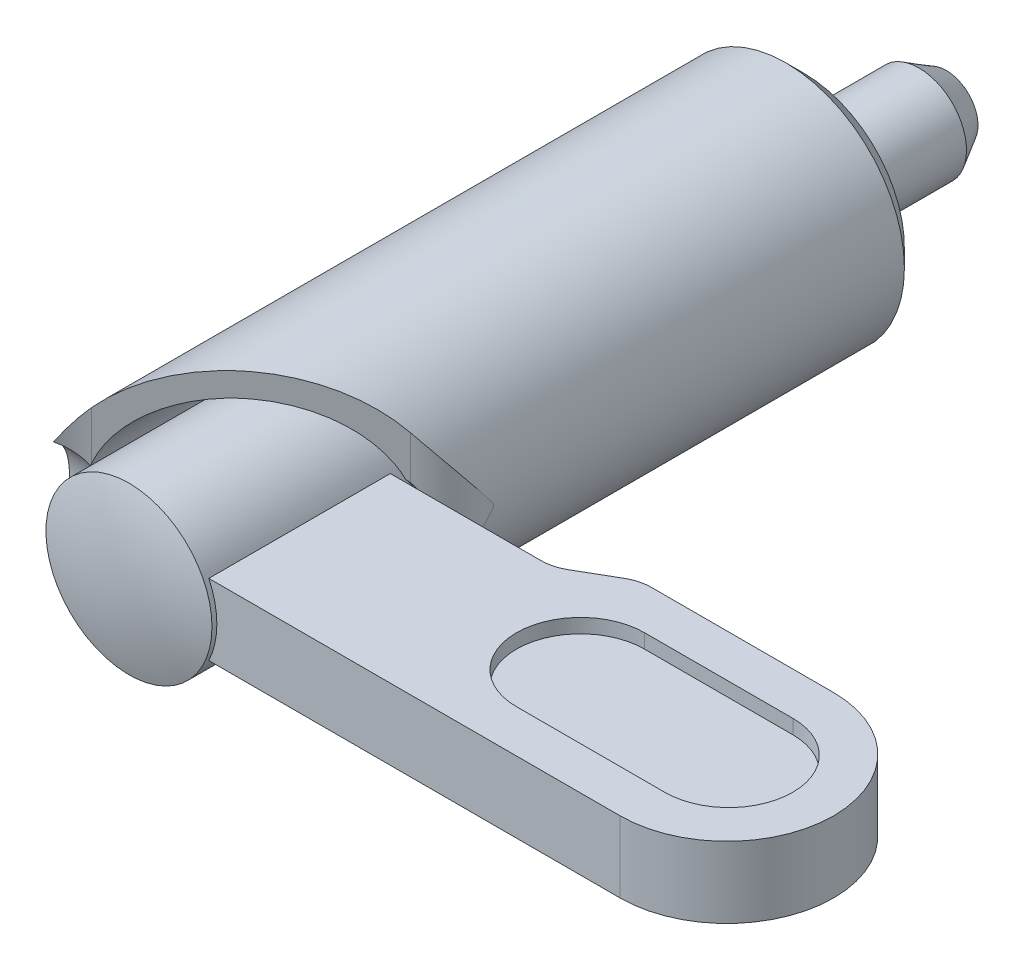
ISO-10303-21;
HEADER;
FILE_DESCRIPTION(('STEP AP214'),'2;1');
FILE_NAME('part.step','',(''),(''),'','','');
FILE_SCHEMA(('AUTOMOTIVE_DESIGN { 1 0 10303 214 1 1 1 1 }'));
ENDSEC;
DATA;
#1=APPLICATION_CONTEXT('core data for automotive mechanical design processes');
#2=APPLICATION_PROTOCOL_DEFINITION('international standard','automotive_design',2000,#1);
#3=PRODUCT_CONTEXT('',#1,'mechanical');
#4=PRODUCT('Part','Part','',(#3));
#5=PRODUCT_RELATED_PRODUCT_CATEGORY('part','',(#4));
#6=PRODUCT_DEFINITION_FORMATION('','',#4);
#7=PRODUCT_DEFINITION_CONTEXT('part definition',#1,'design');
#8=PRODUCT_DEFINITION('design','',#6,#7);
#9=PRODUCT_DEFINITION_SHAPE('','',#8);
#10=(LENGTH_UNIT() NAMED_UNIT(*) SI_UNIT(.MILLI.,.METRE.));
#11=(NAMED_UNIT(*) PLANE_ANGLE_UNIT() SI_UNIT($,.RADIAN.));
#12=(NAMED_UNIT(*) SI_UNIT($,.STERADIAN.) SOLID_ANGLE_UNIT());
#13=UNCERTAINTY_MEASURE_WITH_UNIT(LENGTH_MEASURE(1.E-05),#10,'distance_accuracy_value','');
#14=(GEOMETRIC_REPRESENTATION_CONTEXT(3) GLOBAL_UNCERTAINTY_ASSIGNED_CONTEXT((#13)) GLOBAL_UNIT_ASSIGNED_CONTEXT((#10,
#11,#12)) REPRESENTATION_CONTEXT('',''));
#15=CARTESIAN_POINT('',(0.,0.,0.));
#16=DIRECTION('',(0.,0.,1.));
#17=DIRECTION('',(1.,0.,0.));
#18=AXIS2_PLACEMENT_3D('',#15,#16,#17);
#19=CARTESIAN_POINT('',(-7.6312694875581,40.,52.422851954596));
#20=DIRECTION('',(-0.605044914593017,0.,-0.796191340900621));
#21=DIRECTION('',(0.796191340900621,0.,-0.605044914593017));
#22=AXIS2_PLACEMENT_3D('',#19,#20,#21);
#23=PLANE('',#22);
#24=CARTESIAN_POINT('',(2.50008821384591,0.,44.7237900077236));
#25=DIRECTION('',(-0.605044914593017,0.,-0.796191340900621));
#26=DIRECTION('',(-0.796191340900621,0.,0.605044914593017));
#27=AXIS2_PLACEMENT_3D('',#24,#25,#26);
#28=ELLIPSE('',#27,7.93329533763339,4.79999999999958);
#29=CARTESIAN_POINT('',(7.40709813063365,-3.02239925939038,40.994835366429));
#30=VERTEX_POINT('',#29);
#31=CARTESIAN_POINT('',(7.6312694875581,-2.79917816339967,40.824482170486));
#32=VERTEX_POINT('',#31);
#33=EDGE_CURVE('E307',#30,#32,#28,.F.);
#34=ORIENTED_EDGE('',*,*,#33,.F.);
#35=CARTESIAN_POINT('',(0.,0.,46.623667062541));
#36=DIRECTION('',(-0.605044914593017,0.,-0.796191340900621));
#37=DIRECTION('',(0.796191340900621,0.,-0.605044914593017));
#38=AXIS2_PLACEMENT_3D('',#35,#36,#37);
#39=ELLIPSE('',#38,10.0478359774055,8.);
#40=CARTESIAN_POINT('',(-7.6312694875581,-2.40077612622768,52.422851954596));
#41=VERTEX_POINT('',#40);
#42=EDGE_CURVE('E410',#30,#41,#39,.T.);
#43=ORIENTED_EDGE('',*,*,#42,.T.);
#44=DIRECTION('',(0.,-1.,0.));
#45=VECTOR('',#44,1.);
#46=CARTESIAN_POINT('',(-7.6312694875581,40.,52.422851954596));
#47=LINE('',#46,#45);
#48=CARTESIAN_POINT('',(-7.6312694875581,-6.462486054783,52.422851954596));
#49=VERTEX_POINT('',#48);
#50=EDGE_CURVE('E419',#41,#49,#47,.T.);
#51=ORIENTED_EDGE('',*,*,#50,.T.);
#52=CARTESIAN_POINT('',(0.,0.,46.623667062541));
#53=DIRECTION('',(-0.605044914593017,0.,-0.796191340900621));
#54=DIRECTION('',(0.796191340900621,0.,-0.605044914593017));
#55=AXIS2_PLACEMENT_3D('',#52,#53,#54);
#56=ELLIPSE('',#55,12.5597949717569,10.);
#57=CARTESIAN_POINT('',(7.6312694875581,-6.46248605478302,40.824482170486));
#58=VERTEX_POINT('',#57);
#59=EDGE_CURVE('E439',#49,#58,#56,.F.);
#60=ORIENTED_EDGE('',*,*,#59,.T.);
#61=DIRECTION('',(0.,-1.,0.));
#62=VECTOR('',#61,1.);
#63=CARTESIAN_POINT('',(7.6312694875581,40.,40.824482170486));
#64=LINE('',#63,#62);
#65=EDGE_CURVE('E415',#32,#58,#64,.T.);
#66=ORIENTED_EDGE('',*,*,#65,.F.);
#67=EDGE_LOOP('',(#34,#43,#51,#60,#66));
#68=FACE_BOUND('',#67,.T.);
#69=ADVANCED_FACE('F14',(#68),#23,.F.);
#70=CARTESIAN_POINT('',(4.00100000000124,40.,36.0473341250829));
#71=DIRECTION('',(0.,-1.,0.));
#72=DIRECTION('',(1.,0.,0.));
#73=AXIS2_PLACEMENT_3D('',#70,#71,#72);
#74=CYLINDRICAL_SURFACE('',#73,5.99999999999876);
#75=CARTESIAN_POINT('',(7.6312694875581,-2.79917816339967,40.824482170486));
#76=CARTESIAN_POINT('',(7.6935070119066,-2.73333832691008,40.7771963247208));
#77=CARTESIAN_POINT('',(7.75273824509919,-2.66440048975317,40.7302568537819));
#78=CARTESIAN_POINT('',(7.86504539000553,-2.52066272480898,40.638021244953));
#79=CARTESIAN_POINT('',(7.91812132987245,-2.4458628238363,40.5927250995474));
#80=CARTESIAN_POINT('',(8.01789225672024,-2.29086389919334,40.5047998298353));
#81=CARTESIAN_POINT('',(8.06459776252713,-2.2106741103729,40.4621663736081));
#82=CARTESIAN_POINT('',(8.15171474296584,-2.04527459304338,40.38036276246));
#83=CARTESIAN_POINT('',(8.19212660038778,-1.96006517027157,40.341192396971));
#84=CARTESIAN_POINT('',(8.26675486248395,-1.785109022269,40.267062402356));
#85=CARTESIAN_POINT('',(8.30096545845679,-1.69535814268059,40.2321067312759));
#86=CARTESIAN_POINT('',(8.36327878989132,-1.51199604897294,40.167109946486));
#87=CARTESIAN_POINT('',(8.3913791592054,-1.41838335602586,40.1370707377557));
#88=CARTESIAN_POINT('',(8.44159513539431,-1.22806281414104,40.0824909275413));
#89=CARTESIAN_POINT('',(8.46371396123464,-1.13135666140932,40.0579473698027));
#90=CARTESIAN_POINT('',(8.50215212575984,-0.935466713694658,40.0147597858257));
#91=CARTESIAN_POINT('',(8.51846927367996,-0.836281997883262,39.9961179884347));
#92=CARTESIAN_POINT('',(8.54532656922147,-0.636961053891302,39.9651795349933));
#93=CARTESIAN_POINT('',(8.55591059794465,-0.536838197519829,39.9528347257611));
#94=CARTESIAN_POINT('',(8.57159609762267,-0.335553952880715,39.9344664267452));
#95=CARTESIAN_POINT('',(8.57669569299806,-0.234392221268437,39.9284450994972));
#96=CARTESIAN_POINT('',(8.5814569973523,-0.0317480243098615,39.9228247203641));
#97=CARTESIAN_POINT('',(8.58111790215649,0.0697344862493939,39.9232266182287));
#98=CARTESIAN_POINT('',(8.5749964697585,0.272306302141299,39.9304486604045));
#99=CARTESIAN_POINT('',(8.56921412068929,0.373395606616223,39.9372688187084));
#100=CARTESIAN_POINT('',(8.55202265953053,0.575968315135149,39.9573686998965));
#101=CARTESIAN_POINT('',(8.54053170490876,0.677435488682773,39.9707423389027));
#102=CARTESIAN_POINT('',(8.51178093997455,0.878477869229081,40.0037635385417));
#103=CARTESIAN_POINT('',(8.49452317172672,0.978053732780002,40.0234088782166));
#104=CARTESIAN_POINT('',(8.45408408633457,1.1746607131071,40.0686476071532));
#105=CARTESIAN_POINT('',(8.43090053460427,1.27169085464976,40.0942432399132));
#106=CARTESIAN_POINT('',(8.37846065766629,1.46241275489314,40.150908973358));
#107=CARTESIAN_POINT('',(8.34920674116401,1.55610582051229,40.1819769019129));
#108=CARTESIAN_POINT('',(8.28473174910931,1.73875465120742,40.2487358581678));
#109=CARTESIAN_POINT('',(8.24956129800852,1.82774282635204,40.2843871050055));
#110=CARTESIAN_POINT('',(8.17299086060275,2.00113466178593,40.3598016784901));
#111=CARTESIAN_POINT('',(8.13159332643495,2.08554010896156,40.3995633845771));
#112=CARTESIAN_POINT('',(8.04256845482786,2.24913952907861,40.4823553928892));
#113=CARTESIAN_POINT('',(7.9949491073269,2.32833999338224,40.5253814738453));
#114=CARTESIAN_POINT('',(7.89349170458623,2.48115871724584,40.6138459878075));
#115=CARTESIAN_POINT('',(7.83965709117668,2.55478002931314,40.6592830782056));
#116=CARTESIAN_POINT('',(7.7586085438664,2.65549373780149,40.7250846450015));
#117=CARTESIAN_POINT('',(7.73387693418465,2.68500986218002,40.7448508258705));
#118=CARTESIAN_POINT('',(7.68336394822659,2.74292329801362,40.7845512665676));
#119=CARTESIAN_POINT('',(7.65758404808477,2.77132207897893,40.804485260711));
#120=CARTESIAN_POINT('',(7.6312694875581,2.79917816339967,40.824482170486));
#121=B_SPLINE_CURVE_WITH_KNOTS('',3,(#75,#76,#77,#78,#79,#80,#81,#82,#83,#84,#85,#86,#87,#88,
#89,#90,#91,#92,#93,#94,#95,#96,#97,#98,#99,#100,#101,#102,#103,#104,#105,#106,#107,#108,#109,
#110,#111,#112,#113,#114,#115,#116,#117,#118,#119,#120),.UNSPECIFIED.,.F.,.F.,(4,2,2,2,2,2,2,2,
2,2,2,2,2,2,2,2,2,2,2,2,2,2,4),(0.,0.30651072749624,0.613020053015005,0.919016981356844,
1.22499529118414,1.53125874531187,1.83764058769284,2.1438572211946,2.45018936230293,
2.75414247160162,3.05819949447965,3.36230147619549,3.66640412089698,3.97499817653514,
4.28348307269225,4.59208446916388,4.90056364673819,5.20652637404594,5.5123689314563,
5.81782252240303,6.12310776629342,6.25293927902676,6.38259390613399),.UNSPECIFIED.);
#122=CARTESIAN_POINT('',(7.6312694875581,2.79917816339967,40.824482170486));
#123=VERTEX_POINT('',#122);
#124=EDGE_CURVE('E299',#32,#123,#121,.T.);
#125=ORIENTED_EDGE('',*,*,#124,.F.);
#126=ORIENTED_EDGE('',*,*,#65,.T.);
#127=CARTESIAN_POINT('',(0.,10.,40.5185754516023));
#128=CARTESIAN_POINT('',(-0.12473862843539,9.99999970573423,40.4069540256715));
#129=CARTESIAN_POINT('',(-0.244830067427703,9.9976637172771,40.2900838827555));
#130=CARTESIAN_POINT('',(-0.474811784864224,9.9893849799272,40.0467299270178));
#131=CARTESIAN_POINT('',(-0.584695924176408,9.98344007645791,39.9202404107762));
#132=CARTESIAN_POINT('',(-0.793678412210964,9.96900549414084,39.6583156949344));
#133=CARTESIAN_POINT('',(-0.892752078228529,9.96051015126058,39.522861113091));
#134=CARTESIAN_POINT('',(-1.07920312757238,9.94203724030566,39.2441543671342));
#135=CARTESIAN_POINT('',(-1.16657603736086,9.93205910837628,39.1008992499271));
#136=CARTESIAN_POINT('',(-1.32883904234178,9.9116528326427,38.8079135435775));
#137=CARTESIAN_POINT('',(-1.40375505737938,9.90122568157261,38.6581972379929));
#138=CARTESIAN_POINT('',(-1.54082879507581,9.88082239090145,38.3530045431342));
#139=CARTESIAN_POINT('',(-1.60298660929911,9.87084624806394,38.1975281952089));
#140=CARTESIAN_POINT('',(-1.71408071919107,9.85216225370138,37.8819505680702));
#141=CARTESIAN_POINT('',(-1.76302493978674,9.84345364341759,37.7218521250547));
#142=CARTESIAN_POINT('',(-1.84736920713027,9.82797370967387,37.3980933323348));
#143=CARTESIAN_POINT('',(-1.88277406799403,9.82120169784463,37.2344342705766));
#144=CARTESIAN_POINT('',(-1.93998858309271,9.81006127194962,36.9035130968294));
#145=CARTESIAN_POINT('',(-1.96170317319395,9.80570968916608,36.7362339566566));
#146=CARTESIAN_POINT('',(-1.99097490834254,9.79980830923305,36.4003901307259));
#147=CARTESIAN_POINT('',(-1.99853195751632,9.79825853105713,36.23182543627));
#148=CARTESIAN_POINT('',(-1.9994258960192,9.79807615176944,35.89464711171));
#149=CARTESIAN_POINT('',(-1.99276196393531,9.79944371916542,35.7260334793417));
#150=CARTESIAN_POINT('',(-1.96526738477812,9.80499464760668,35.3900143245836));
#151=CARTESIAN_POINT('',(-1.94443689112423,9.80917797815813,35.2226087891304));
#152=CARTESIAN_POINT('',(-1.88928667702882,9.81994742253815,34.8932575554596));
#153=CARTESIAN_POINT('',(-1.85521969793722,9.8264883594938,34.7312679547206));
#154=CARTESIAN_POINT('',(-1.77383611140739,9.8415047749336,34.4106827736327));
#155=CARTESIAN_POINT('',(-1.72651470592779,9.84998095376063,34.2520884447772));
#156=CARTESIAN_POINT('',(-1.61897344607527,9.86822659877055,33.9394384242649));
#157=CARTESIAN_POINT('',(-1.55875536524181,9.87799588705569,33.7853821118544));
#158=CARTESIAN_POINT('',(-1.42580267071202,9.89806067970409,33.4827405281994));
#159=CARTESIAN_POINT('',(-1.35306362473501,9.90835636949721,33.334157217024));
#160=CARTESIAN_POINT('',(-1.19422596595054,9.92876331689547,33.0410270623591));
#161=CARTESIAN_POINT('',(-1.10792255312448,9.93886852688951,32.8965907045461));
#162=CARTESIAN_POINT('',(-0.923447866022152,9.95770238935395,32.6154125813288));
#163=CARTESIAN_POINT('',(-0.825276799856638,9.96643106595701,32.4786706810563));
#164=CARTESIAN_POINT('',(-0.617695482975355,9.98144679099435,32.2138020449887));
#165=CARTESIAN_POINT('',(-0.508282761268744,9.98773330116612,32.0856772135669));
#166=CARTESIAN_POINT('',(-0.279044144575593,9.99676359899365,31.8390624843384));
#167=CARTESIAN_POINT('',(-0.159222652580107,9.99950887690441,31.7205685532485));
#168=CARTESIAN_POINT('',(0.0888744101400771,10.0003674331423,31.4950684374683));
#169=CARTESIAN_POINT('',(0.21706574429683,9.99852150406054,31.3879698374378));
#170=CARTESIAN_POINT('',(0.481753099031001,9.98926607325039,31.1849577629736));
#171=CARTESIAN_POINT('',(0.618245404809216,9.98185904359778,31.0890393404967));
#172=CARTESIAN_POINT('',(0.898326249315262,9.96055832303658,30.9091335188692));
#173=CARTESIAN_POINT('',(1.04191175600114,9.94666738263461,30.8251410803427));
#174=CARTESIAN_POINT('',(1.33485578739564,9.91160484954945,30.66968001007));
#175=CARTESIAN_POINT('',(1.48421384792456,9.89043384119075,30.5982103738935));
#176=CARTESIAN_POINT('',(1.77582636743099,9.84208422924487,30.4731204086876));
#177=CARTESIAN_POINT('',(1.91777457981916,9.81547460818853,30.4185639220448));
#178=CARTESIAN_POINT('',(2.20403918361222,9.75518330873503,30.320746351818));
#179=CARTESIAN_POINT('',(2.34835549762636,9.72150186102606,30.277484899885));
#180=CARTESIAN_POINT('',(2.63803523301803,9.64692366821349,30.2022747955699));
#181=CARTESIAN_POINT('',(2.78339847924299,9.60602810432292,30.1703242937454));
#182=CARTESIAN_POINT('',(3.07393596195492,9.51703737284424,30.1175488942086));
#183=CARTESIAN_POINT('',(3.21911019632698,9.46894212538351,30.0967241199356));
#184=CARTESIAN_POINT('',(3.50392168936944,9.36721622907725,30.0662947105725));
#185=CARTESIAN_POINT('',(3.64359793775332,9.3137850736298,30.0563839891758));
#186=CARTESIAN_POINT('',(3.9207488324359,9.20055147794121,30.0462677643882));
#187=CARTESIAN_POINT('',(4.05822266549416,9.14074674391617,30.0460657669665));
#188=CARTESIAN_POINT('',(4.3301016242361,9.01513427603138,30.0548226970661));
#189=CARTESIAN_POINT('',(4.46450654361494,8.94932614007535,30.0637822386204));
#190=CARTESIAN_POINT('',(4.72957767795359,8.81211567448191,30.0902438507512));
#191=CARTESIAN_POINT('',(4.8602431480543,8.74071224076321,30.1077476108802));
#192=CARTESIAN_POINT('',(5.16506270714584,8.56524813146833,30.1586251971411));
#193=CARTESIAN_POINT('',(5.33733590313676,8.45891116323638,30.1954792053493));
#194=CARTESIAN_POINT('',(5.67283093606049,8.23768208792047,30.2823507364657));
#195=CARTESIAN_POINT('',(5.83605006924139,8.12278744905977,30.3323721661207));
#196=CARTESIAN_POINT('',(6.15302801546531,7.88539816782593,30.4440272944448));
#197=CARTESIAN_POINT('',(6.30677391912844,7.76289359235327,30.5056763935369));
#198=CARTESIAN_POINT('',(6.60429221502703,7.51141068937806,30.6390571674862));
#199=CARTESIAN_POINT('',(6.74806184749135,7.38243058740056,30.7107916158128));
#200=CARTESIAN_POINT('',(7.07780458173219,7.06923397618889,30.891682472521));
#201=CARTESIAN_POINT('',(7.25926704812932,6.8825172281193,31.004754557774));
#202=CARTESIAN_POINT('',(7.60324574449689,6.50052104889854,31.244439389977));
#203=CARTESIAN_POINT('',(7.7657550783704,6.30523853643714,31.3710570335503));
#204=CARTESIAN_POINT('',(8.07251380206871,5.90742861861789,31.6355481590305));
#205=CARTESIAN_POINT('',(8.21673092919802,5.70488919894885,31.7734408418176));
#206=CARTESIAN_POINT('',(8.48713261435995,5.29424452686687,32.0582030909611));
#207=CARTESIAN_POINT('',(8.61331727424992,5.08613930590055,32.2050726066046));
#208=CARTESIAN_POINT('',(8.89314859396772,4.58506163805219,32.5635834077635));
#209=CARTESIAN_POINT('',(9.0388826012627,4.29002645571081,32.7785427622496));
#210=CARTESIAN_POINT('',(9.29855931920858,3.69359577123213,33.2186964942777));
#211=CARTESIAN_POINT('',(9.41248786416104,3.39219749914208,33.4438953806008));
#212=CARTESIAN_POINT('',(9.60953308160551,2.78540069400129,33.9011267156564));
#213=CARTESIAN_POINT('',(9.69269853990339,2.48000929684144,34.1331477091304));
#214=CARTESIAN_POINT('',(9.82933521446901,1.86627625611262,34.6016362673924));
#215=CARTESIAN_POINT('',(9.88281886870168,1.55793590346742,34.8381019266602));
#216=CARTESIAN_POINT('',(9.94555880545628,1.05934119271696,35.2204698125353));
#217=CARTESIAN_POINT('',(9.96392644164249,0.86981469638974,35.3658152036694));
#218=CARTESIAN_POINT('',(9.98467218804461,0.565187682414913,35.5965399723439));
#219=CARTESIAN_POINT('',(9.99050869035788,0.450726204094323,35.6825883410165));
#220=CARTESIAN_POINT('',(9.99633608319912,0.276847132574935,35.8074779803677));
#221=CARTESIAN_POINT('',(9.99779034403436,0.21901237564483,35.8480900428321));
#222=CARTESIAN_POINT('',(9.99900329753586,0.142034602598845,35.8922563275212));
#223=CARTESIAN_POINT('',(9.99921969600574,0.125997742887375,35.9009608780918));
#224=CARTESIAN_POINT('',(9.99958052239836,0.0930680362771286,35.9166071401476));
#225=CARTESIAN_POINT('',(9.99972515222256,0.0761777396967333,35.9235537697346));
#226=CARTESIAN_POINT('',(9.99989238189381,0.047679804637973,35.9319997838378));
#227=CARTESIAN_POINT('',(9.9999402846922,0.0364074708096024,35.9345626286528));
#228=CARTESIAN_POINT('',(9.99999714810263,0.0136194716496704,35.937625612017));
#229=CARTESIAN_POINT('',(10.0000063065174,0.00210534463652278,35.9381362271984));
#230=CARTESIAN_POINT('',(9.99998495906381,-0.0207969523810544,35.9369743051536));
#231=CARTESIAN_POINT('',(9.99995446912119,-0.0321851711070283,35.9353026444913));
#232=CARTESIAN_POINT('',(9.99985721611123,-0.0546051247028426,35.9302045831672));
#233=CARTESIAN_POINT('',(9.99979023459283,-0.0656342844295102,35.9267676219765));
#234=CARTESIAN_POINT('',(9.99942973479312,-0.112913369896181,35.9094870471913));
#235=CARTESIAN_POINT('',(9.99897548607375,-0.147006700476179,35.8902804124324));
#236=CARTESIAN_POINT('',(9.99777233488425,-0.213654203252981,35.8493871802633));
#237=CARTESIAN_POINT('',(9.99702073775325,-0.246191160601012,35.827679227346));
#238=CARTESIAN_POINT('',(9.99436015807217,-0.341744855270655,35.7618469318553));
#239=CARTESIAN_POINT('',(9.99203431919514,-0.403862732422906,35.716313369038));
#240=CARTESIAN_POINT('',(9.98626681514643,-0.527525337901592,35.6245570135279));
#241=CARTESIAN_POINT('',(9.98282409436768,-0.589069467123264,35.5783336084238));
#242=CARTESIAN_POINT('',(9.97484612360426,-0.711468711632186,35.4858251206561));
#243=CARTESIAN_POINT('',(9.97031775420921,-0.772325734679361,35.4395421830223));
#244=CARTESIAN_POINT('',(9.96015790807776,-0.893849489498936,35.3468950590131));
#245=CARTESIAN_POINT('',(9.9545267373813,-0.954516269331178,35.3005308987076));
#246=CARTESIAN_POINT('',(9.92337156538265,-1.25985988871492,35.066947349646));
#247=CARTESIAN_POINT('',(9.88938041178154,-1.50370705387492,34.8796729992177));
#248=CARTESIAN_POINT('',(9.80312505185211,-1.98989116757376,34.5072134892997));
#249=CARTESIAN_POINT('',(9.75085332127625,-2.23222745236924,34.322029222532));
#250=CARTESIAN_POINT('',(9.62745343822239,-2.71562340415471,33.9543089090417));
#251=CARTESIAN_POINT('',(9.55625510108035,-2.95667484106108,33.7717854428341));
#252=CARTESIAN_POINT('',(9.39462784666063,-3.4358235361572,33.4114713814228));
#253=CARTESIAN_POINT('',(9.30420126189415,-3.67392114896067,33.2336802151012));
#254=CARTESIAN_POINT('',(9.10305684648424,-4.14738630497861,32.8834798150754));
#255=CARTESIAN_POINT('',(8.99224802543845,-4.38273636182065,32.7110989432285));
#256=CARTESIAN_POINT('',(8.74989850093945,-4.8485277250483,32.3743221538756));
#257=CARTESIAN_POINT('',(8.61835476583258,-5.07896830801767,32.209927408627));
#258=CARTESIAN_POINT('',(8.33400572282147,-5.53316975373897,31.8915532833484));
#259=CARTESIAN_POINT('',(8.18123945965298,-5.75694198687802,31.7375555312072));
#260=CARTESIAN_POINT('',(7.85363788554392,-6.19641354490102,31.4423563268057));
#261=CARTESIAN_POINT('',(7.67881179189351,-6.41211619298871,31.301149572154));
#262=CARTESIAN_POINT('',(7.23489854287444,-6.91427249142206,30.9835299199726));
#263=CARTESIAN_POINT('',(6.95531389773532,-7.1962794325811,30.8142717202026));
#264=CARTESIAN_POINT('',(6.50330218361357,-7.59920169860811,30.5914490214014));
#265=CARTESIAN_POINT('',(6.34721886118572,-7.73014259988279,30.5223604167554));
#266=CARTESIAN_POINT('',(6.02428949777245,-7.98436601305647,30.3961100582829));
#267=CARTESIAN_POINT('',(5.8574454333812,-8.10764992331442,30.3389461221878));
#268=CARTESIAN_POINT('',(5.54585808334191,-8.32299821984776,30.2478003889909));
#269=CARTESIAN_POINT('',(5.40284287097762,-8.41657970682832,30.211481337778));
#270=CARTESIAN_POINT('',(5.11060029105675,-8.59716511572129,30.1489356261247));
#271=CARTESIAN_POINT('',(4.96137438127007,-8.68417056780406,30.1227066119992));
#272=CARTESIAN_POINT('',(4.65744092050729,-8.85089122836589,30.0813809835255));
#273=CARTESIAN_POINT('',(4.5027348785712,-8.93060842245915,30.0662813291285));
#274=CARTESIAN_POINT('',(4.18876684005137,-9.08210369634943,30.0482121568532));
#275=CARTESIAN_POINT('',(4.02950480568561,-9.15388171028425,30.0452427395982));
#276=CARTESIAN_POINT('',(3.70634452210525,-9.28945413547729,30.0523773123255));
#277=CARTESIAN_POINT('',(3.54241897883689,-9.35317831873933,30.0625886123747));
#278=CARTESIAN_POINT('',(3.21273098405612,-9.4714849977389,30.0970318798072));
#279=CARTESIAN_POINT('',(3.04696851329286,-9.52606739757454,30.1212639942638));
#280=CARTESIAN_POINT('',(2.71545438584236,-9.62581194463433,30.1842442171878));
#281=CARTESIAN_POINT('',(2.54970276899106,-9.67097901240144,30.2229847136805));
#282=CARTESIAN_POINT('',(2.22002588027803,-9.75193757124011,30.3151952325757));
#283=CARTESIAN_POINT('',(2.05610037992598,-9.78773024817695,30.3686633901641));
#284=CARTESIAN_POINT('',(1.75339268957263,-9.84612394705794,30.4821886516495));
#285=CARTESIAN_POINT('',(1.61414645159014,-9.86984233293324,30.540445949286));
#286=CARTESIAN_POINT('',(1.33967952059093,-9.91082783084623,30.6677196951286));
#287=CARTESIAN_POINT('',(1.20445875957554,-9.92809505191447,30.7367359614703));
#288=CARTESIAN_POINT('',(0.939184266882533,-9.95669296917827,30.8851268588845));
#289=CARTESIAN_POINT('',(0.80913040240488,-9.96802381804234,30.9645012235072));
#290=CARTESIAN_POINT('',(0.555202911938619,-9.98538678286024,31.1330984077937));
#291=CARTESIAN_POINT('',(0.431329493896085,-9.99141872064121,31.2223215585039));
#292=CARTESIAN_POINT('',(0.191594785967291,-9.99887808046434,31.4093005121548));
#293=CARTESIAN_POINT('',(0.0756788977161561,-10.0003407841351,31.5069849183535));
#294=CARTESIAN_POINT('',(-0.148438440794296,-9.99952686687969,31.7108450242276));
#295=CARTESIAN_POINT('',(-0.256637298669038,-9.99724899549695,31.8170235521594));
#296=CARTESIAN_POINT('',(-0.568591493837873,-9.98598842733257,32.1472805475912));
#297=CARTESIAN_POINT('',(-0.75986244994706,-9.97258159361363,32.3832038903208));
#298=CARTESIAN_POINT('',(-1.1176146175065,-9.93910544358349,32.8999695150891));
#299=CARTESIAN_POINT('',(-1.28109610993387,-9.91860628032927,33.18286476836));
#300=CARTESIAN_POINT('',(-1.49029518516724,-9.88857573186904,33.6240541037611));
#301=CARTESIAN_POINT('',(-1.55405163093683,-9.87867955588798,33.7740195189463));
#302=CARTESIAN_POINT('',(-1.66917220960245,-9.85988239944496,34.0786739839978));
#303=CARTESIAN_POINT('',(-1.72054083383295,-9.85098105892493,34.233361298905));
#304=CARTESIAN_POINT('',(-1.81221792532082,-9.83453693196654,34.5523225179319));
#305=CARTESIAN_POINT('',(-1.85204221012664,-9.8270572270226,34.716738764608));
#306=CARTESIAN_POINT('',(-1.91768182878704,-9.81445953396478,35.0484417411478));
#307=CARTESIAN_POINT('',(-1.9434967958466,-9.80934160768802,35.2157285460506));
#308=CARTESIAN_POINT('',(-1.98090349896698,-9.80185627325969,35.5519219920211));
#309=CARTESIAN_POINT('',(-1.99249734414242,-9.7994884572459,35.7208283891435));
#310=CARTESIAN_POINT('',(-2.00137256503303,-9.79767978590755,36.0590302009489));
#311=CARTESIAN_POINT('',(-1.99865424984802,-9.79823886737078,36.2283256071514));
#312=CARTESIAN_POINT('',(-1.97910969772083,-9.80220485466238,36.5629524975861));
#313=CARTESIAN_POINT('',(-1.96254260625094,-9.80555944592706,36.7282998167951));
#314=CARTESIAN_POINT('',(-1.91577025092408,-9.81480470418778,37.0569796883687));
#315=CARTESIAN_POINT('',(-1.88556510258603,-9.82069534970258,37.2203122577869));
#316=CARTESIAN_POINT('',(-1.81174925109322,-9.83458044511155,37.5438210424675));
#317=CARTESIAN_POINT('',(-1.76813889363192,-9.84257484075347,37.7039973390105));
#318=CARTESIAN_POINT('',(-1.66781195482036,-9.86007071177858,38.0201723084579));
#319=CARTESIAN_POINT('',(-1.61109032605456,-9.86957276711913,38.1761693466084));
#320=CARTESIAN_POINT('',(-1.48457339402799,-9.88939649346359,38.4837876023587));
#321=CARTESIAN_POINT('',(-1.41470342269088,-9.89972264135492,38.6353778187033));
#322=CARTESIAN_POINT('',(-1.26257838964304,-9.92027135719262,38.9322183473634));
#323=CARTESIAN_POINT('',(-1.18032331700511,-9.9304939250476,39.077468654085));
#324=CARTESIAN_POINT('',(-1.00392590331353,-9.94987466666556,39.3607259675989));
#325=CARTESIAN_POINT('',(-0.909778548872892,-9.95903238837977,39.4987298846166));
#326=CARTESIAN_POINT('',(-0.710285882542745,-9.97524440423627,39.7664248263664));
#327=CARTESIAN_POINT('',(-0.6049459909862,-9.98229971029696,39.8961198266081));
#328=CARTESIAN_POINT('',(-0.38254301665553,-9.99330708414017,40.1477050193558));
#329=CARTESIAN_POINT('',(-0.265365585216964,-9.9972248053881,40.2694957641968));
#330=CARTESIAN_POINT('',(-0.0211687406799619,-10.0007225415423,40.5027411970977));
#331=CARTESIAN_POINT('',(0.105846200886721,-10.0003045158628,40.6142005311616));
#332=CARTESIAN_POINT('',(0.368712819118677,-9.99406453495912,40.8259282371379));
#333=CARTESIAN_POINT('',(0.504561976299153,-9.98824411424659,40.9261997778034));
#334=CARTESIAN_POINT('',(0.783932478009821,-9.97020727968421,41.1147664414));
#335=CARTESIAN_POINT('',(0.927453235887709,-9.95799135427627,41.2030624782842));
#336=CARTESIAN_POINT('',(1.21190721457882,-9.92725987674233,41.3620193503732));
#337=CARTESIAN_POINT('',(1.35247102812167,-9.90917049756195,41.4334242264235));
#338=CARTESIAN_POINT('',(1.63788521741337,-9.8660101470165,41.5646117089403));
#339=CARTESIAN_POINT('',(1.78273540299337,-9.8409394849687,41.6243948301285));
#340=CARTESIAN_POINT('',(2.07529956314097,-9.78342206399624,41.7320474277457));
#341=CARTESIAN_POINT('',(2.22301236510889,-9.75097826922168,41.779921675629));
#342=CARTESIAN_POINT('',(2.51995127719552,-9.67849150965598,41.8637154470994));
#343=CARTESIAN_POINT('',(2.66917734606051,-9.63844875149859,41.8996352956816));
#344=CARTESIAN_POINT('',(2.95897765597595,-9.55331911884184,41.9578956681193));
#345=CARTESIAN_POINT('',(3.09954514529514,-9.50866677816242,41.9809099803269));
#346=CARTESIAN_POINT('',(3.37975462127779,-9.41271463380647,42.0167572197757));
#347=CARTESIAN_POINT('',(3.51939627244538,-9.36141254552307,42.0295866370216));
#348=CARTESIAN_POINT('',(3.79669948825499,-9.25241948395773,42.0454628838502));
#349=CARTESIAN_POINT('',(3.93436127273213,-9.19472922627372,42.0485108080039));
#350=CARTESIAN_POINT('',(4.20691208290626,-9.0732665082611,42.0453492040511));
#351=CARTESIAN_POINT('',(4.34180004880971,-9.00949177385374,42.0391362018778));
#352=CARTESIAN_POINT('',(4.61620841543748,-8.87217946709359,42.0173928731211));
#353=CARTESIAN_POINT('',(4.75550585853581,-8.79828306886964,42.0013146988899));
#354=CARTESIAN_POINT('',(5.02946778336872,-8.64460347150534,41.960156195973));
#355=CARTESIAN_POINT('',(5.16413043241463,-8.56481798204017,41.9350723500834));
#356=CARTESIAN_POINT('',(5.56031428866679,-8.31743027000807,41.8474744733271));
#357=CARTESIAN_POINT('',(5.81418638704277,-8.14171876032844,41.772600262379));
#358=CARTESIAN_POINT('',(6.24373788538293,-7.81481855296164,41.6159965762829));
#359=CARTESIAN_POINT('',(6.42411916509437,-7.66706669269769,41.5396438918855));
#360=CARTESIAN_POINT('',(6.77073728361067,-7.36276242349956,41.3732609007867));
#361=CARTESIAN_POINT('',(6.93696803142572,-7.20620627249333,41.2832247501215));
#362=CARTESIAN_POINT('',(7.25546521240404,-6.88545221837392,41.0914501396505));
#363=CARTESIAN_POINT('',(7.4076988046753,-6.72123764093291,40.989685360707));
#364=CARTESIAN_POINT('',(7.69796563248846,-6.38673329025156,40.7764849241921));
#365=CARTESIAN_POINT('',(7.83599940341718,-6.21644374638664,40.6650496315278));
#366=CARTESIAN_POINT('',(8.15071166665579,-5.80156839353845,40.3878155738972));
#367=CARTESIAN_POINT('',(8.32073945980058,-5.55453041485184,40.2181123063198));
#368=CARTESIAN_POINT('',(8.63469695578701,-5.05269240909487,39.8662978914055));
#369=CARTESIAN_POINT('',(8.77860934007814,-4.79788736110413,39.6841786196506));
#370=CARTESIAN_POINT('',(9.04168077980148,-4.28160935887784,39.3098504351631));
#371=CARTESIAN_POINT('',(9.16076415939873,-4.02011866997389,39.1176128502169));
#372=CARTESIAN_POINT('',(9.32100834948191,-3.6247737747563,38.8240077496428));
#373=CARTESIAN_POINT('',(9.37133500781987,-3.49255392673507,38.7253251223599));
#374=CARTESIAN_POINT('',(9.46600910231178,-3.22715342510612,38.526407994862));
#375=CARTESIAN_POINT('',(9.51035712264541,-3.09397286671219,38.4261736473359));
#376=CARTESIAN_POINT('',(9.58819238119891,-2.8428351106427,38.2365095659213));
#377=CARTESIAN_POINT('',(9.62234432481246,-2.72497072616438,38.1472280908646));
#378=CARTESIAN_POINT('',(9.68615525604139,-2.48865027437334,37.9677718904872));
#379=CARTESIAN_POINT('',(9.71581294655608,-2.37019404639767,37.8775969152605));
#380=CARTESIAN_POINT('',(9.77081221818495,-2.13218755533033,37.6960632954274));
#381=CARTESIAN_POINT('',(9.79613075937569,-2.01263480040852,37.6047009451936));
#382=CARTESIAN_POINT('',(9.8422790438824,-1.77324163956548,37.4215141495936));
#383=CARTESIAN_POINT('',(9.86311389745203,-1.65340172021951,37.3296903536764));
#384=CARTESIAN_POINT('',(9.90004889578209,-1.41537663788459,37.1472147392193));
#385=CARTESIAN_POINT('',(9.91622352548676,-1.29719798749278,37.0565695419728));
#386=CARTESIAN_POINT('',(9.93733506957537,-1.11935568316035,36.9202902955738));
#387=CARTESIAN_POINT('',(9.94385873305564,-1.05983919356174,36.8747048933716));
#388=CARTESIAN_POINT('',(9.95583206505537,-0.940737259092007,36.7835981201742));
#389=CARTESIAN_POINT('',(9.96128272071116,-0.881151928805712,36.7380767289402));
#390=CARTESIAN_POINT('',(9.97103072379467,-0.762892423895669,36.6479558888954));
#391=CARTESIAN_POINT('',(9.97534713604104,-0.704221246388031,36.6033546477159));
#392=CARTESIAN_POINT('',(9.98296757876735,-0.586388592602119,36.5143182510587));
#393=CARTESIAN_POINT('',(9.98626816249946,-0.527226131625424,36.4698841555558));
#394=CARTESIAN_POINT('',(9.99180589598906,-0.409020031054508,36.3821817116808));
#395=CARTESIAN_POINT('',(9.99405506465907,-0.349983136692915,36.33890580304));
#396=CARTESIAN_POINT('',(9.9966620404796,-0.260063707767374,36.2764170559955));
#397=CARTESIAN_POINT('',(9.99740206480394,-0.229962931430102,36.256053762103));
#398=CARTESIAN_POINT('',(9.99862604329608,-0.168609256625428,36.2171510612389));
#399=CARTESIAN_POINT('',(9.99911111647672,-0.137362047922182,36.1986039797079));
#400=CARTESIAN_POINT('',(9.99952812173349,-0.0973930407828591,36.1802726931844));
#401=CARTESIAN_POINT('',(9.99959525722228,-0.0902565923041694,36.1771936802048));
#402=CARTESIAN_POINT('',(9.9997153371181,-0.0758028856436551,36.1715188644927));
#403=CARTESIAN_POINT('',(9.99976829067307,-0.0684857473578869,36.1689227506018));
#404=CARTESIAN_POINT('',(9.99990257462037,-0.046469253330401,36.1621759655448));
#405=CARTESIAN_POINT('',(9.99996211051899,-0.0314477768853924,36.1589364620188));
#406=CARTESIAN_POINT('',(10.0000062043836,-0.00430205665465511,36.1565399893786));
#407=CARTESIAN_POINT('',(10.0000040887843,0.00775372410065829,36.1566572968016));
#408=CARTESIAN_POINT('',(9.99995697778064,0.0317095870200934,36.1592127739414));
#409=CARTESIAN_POINT('',(9.99991157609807,0.0436071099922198,36.1616729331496));
#410=CARTESIAN_POINT('',(9.9997055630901,0.0809651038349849,36.1721433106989));
#411=CARTESIAN_POINT('',(9.99947203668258,0.105461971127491,36.1832683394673));
#412=CARTESIAN_POINT('',(9.99885698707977,0.15306514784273,36.2081997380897));
#413=CARTESIAN_POINT('',(9.9984741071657,0.176156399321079,36.2220300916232));
#414=CARTESIAN_POINT('',(9.99698783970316,0.250881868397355,36.2691069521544));
#415=CARTESIAN_POINT('',(9.99558997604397,0.301163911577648,36.3045179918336));
#416=CARTESIAN_POINT('',(9.99208204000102,0.400952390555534,36.3763809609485));
#417=CARTESIAN_POINT('',(9.98997098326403,0.450457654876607,36.4128342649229));
#418=CARTESIAN_POINT('',(9.98505142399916,0.548781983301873,36.4860320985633));
#419=CARTESIAN_POINT('',(9.98224717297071,0.597603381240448,36.522773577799));
#420=CARTESIAN_POINT('',(9.97593698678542,0.695023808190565,36.5964239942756));
#421=CARTESIAN_POINT('',(9.97243143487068,0.743622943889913,36.6333328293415));
#422=CARTESIAN_POINT('',(9.95308429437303,0.987110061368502,36.8186389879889));
#423=CARTESIAN_POINT('',(9.93192134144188,1.18118962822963,36.9675947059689));
#424=CARTESIAN_POINT('',(9.87815692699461,1.56850107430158,37.2646627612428));
#425=CARTESIAN_POINT('',(9.84555122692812,1.76173261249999,37.4127747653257));
#426=CARTESIAN_POINT('',(9.76861315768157,2.1478141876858,37.7080525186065));
#427=CARTESIAN_POINT('',(9.72423578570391,2.34065983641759,37.8552123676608));
#428=CARTESIAN_POINT('',(9.62362746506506,2.72492874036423,38.1473180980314));
#429=CARTESIAN_POINT('',(9.56739610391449,2.91635194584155,38.292263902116));
#430=CARTESIAN_POINT('',(9.41114449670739,3.39438561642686,38.6523421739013));
#431=CARTESIAN_POINT('',(9.30340014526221,3.67988223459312,38.8656701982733));
#432=CARTESIAN_POINT('',(9.05933010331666,4.24540248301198,39.2833575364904));
#433=CARTESIAN_POINT('',(8.92299259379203,4.52542379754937,39.4877130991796));
#434=CARTESIAN_POINT('',(8.62081440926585,5.07743184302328,39.8838995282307));
#435=CARTESIAN_POINT('',(8.45503498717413,5.34943391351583,40.0757552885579));
#436=CARTESIAN_POINT('',(8.09266234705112,5.88327336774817,40.4433451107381));
#437=CARTESIAN_POINT('',(7.89609242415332,6.14511825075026,40.6190912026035));
#438=CARTESIAN_POINT('',(7.43068824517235,6.70375629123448,40.9808443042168));
#439=CARTESIAN_POINT('',(7.15521461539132,6.99791835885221,41.1626156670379));
#440=CARTESIAN_POINT('',(6.70766274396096,7.41952148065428,41.4048253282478));
#441=CARTESIAN_POINT('',(6.55280275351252,7.55674731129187,41.4804706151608));
#442=CARTESIAN_POINT('',(6.23165776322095,7.82368081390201,41.6200175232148));
#443=CARTESIAN_POINT('',(6.06537471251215,7.95338976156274,41.6839211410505));
#444=CARTESIAN_POINT('',(5.754117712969,8.18046237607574,41.7873856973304));
#445=CARTESIAN_POINT('',(5.61100496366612,8.27932642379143,41.8292643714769));
#446=CARTESIAN_POINT('',(5.31799179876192,8.47051028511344,41.9029590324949));
#447=CARTESIAN_POINT('',(5.16809299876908,8.56283164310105,41.9347774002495));
#448=CARTESIAN_POINT('',(4.8621699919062,8.74016880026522,41.9872383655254));
#449=CARTESIAN_POINT('',(4.70614732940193,8.82518642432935,42.0078837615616));
#450=CARTESIAN_POINT('',(4.38885213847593,8.98719647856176,42.0369038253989));
#451=CARTESIAN_POINT('',(4.22757957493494,9.0641888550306,42.0452784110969));
#452=CARTESIAN_POINT('',(3.89953954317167,9.21010831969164,42.0487376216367));
#453=CARTESIAN_POINT('',(3.73273597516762,9.27895763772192,42.043703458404));
#454=CARTESIAN_POINT('',(3.39655475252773,9.40721943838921,42.0191884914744));
#455=CARTESIAN_POINT('',(3.22717704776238,9.4666317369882,41.99970740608));
#456=CARTESIAN_POINT('',(2.88770719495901,9.57564204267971,41.9456483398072));
#457=CARTESIAN_POINT('',(2.71761523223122,9.62524245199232,41.9110740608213));
#458=CARTESIAN_POINT('',(2.37869306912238,9.7145517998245,41.8264871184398));
#459=CARTESIAN_POINT('',(2.20986264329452,9.75426254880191,41.7764772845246));
#460=CARTESIAN_POINT('',(1.89971219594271,9.81898439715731,41.6693880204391));
#461=CARTESIAN_POINT('',(1.75794316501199,9.84529058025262,41.6143753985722));
#462=CARTESIAN_POINT('',(1.47809964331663,9.89117381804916,41.4932693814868));
#463=CARTESIAN_POINT('',(1.34002496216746,9.91075122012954,41.4271765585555));
#464=CARTESIAN_POINT('',(1.06900494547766,9.9436330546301,41.2843973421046));
#465=CARTESIAN_POINT('',(0.936051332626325,9.95694803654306,41.2077290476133));
#466=CARTESIAN_POINT('',(0.676154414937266,9.97796587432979,41.0442286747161));
#467=CARTESIAN_POINT('',(0.549208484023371,9.98567120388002,40.957401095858));
#468=CARTESIAN_POINT('',(0.352201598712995,9.9940672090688,40.8112258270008));
#469=CARTESIAN_POINT('',(0.279893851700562,9.99633443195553,40.7549620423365));
#470=CARTESIAN_POINT('',(0.137927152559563,9.99930073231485,40.6391808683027));
#471=CARTESIAN_POINT('',(0.0682676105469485,10.0000001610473,40.579664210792));
#472=CARTESIAN_POINT('',(0.,10.,40.5185754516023));
#473=B_SPLINE_CURVE_WITH_KNOTS('',3,(#127,#128,#129,#130,#131,#132,#133,#134,#135,#136,#137,
#138,#139,#140,#141,#142,#143,#144,#145,#146,#147,#148,#149,#150,#151,#152,#153,#154,#155,#156,
#157,#158,#159,#160,#161,#162,#163,#164,#165,#166,#167,#168,#169,#170,#171,#172,#173,#174,#175,
#176,#177,#178,#179,#180,#181,#182,#183,#184,#185,#186,#187,#188,#189,#190,#191,#192,#193,#194,
#195,#196,#197,#198,#199,#200,#201,#202,#203,#204,#205,#206,#207,#208,#209,#210,#211,#212,#213,
#214,#215,#216,#217,#218,#219,#220,#221,#222,#223,#224,#225,#226,#227,#228,#229,#230,#231,#232,
#233,#234,#235,#236,#237,#238,#239,#240,#241,#242,#243,#244,#245,#246,#247,#248,#249,#250,#251,
#252,#253,#254,#255,#256,#257,#258,#259,#260,#261,#262,#263,#264,#265,#266,#267,#268,#269,#270,
#271,#272,#273,#274,#275,#276,#277,#278,#279,#280,#281,#282,#283,#284,#285,#286,#287,#288,#289,
#290,#291,#292,#293,#294,#295,#296,#297,#298,#299,#300,#301,#302,#303,#304,#305,#306,#307,#308,
#309,#310,#311,#312,#313,#314,#315,#316,#317,#318,#319,#320,#321,#322,#323,#324,#325,#326,#327,
#328,#329,#330,#331,#332,#333,#334,#335,#336,#337,#338,#339,#340,#341,#342,#343,#344,#345,#346,
#347,#348,#349,#350,#351,#352,#353,#354,#355,#356,#357,#358,#359,#360,#361,#362,#363,#364,#365,
#366,#367,#368,#369,#370,#371,#372,#373,#374,#375,#376,#377,#378,#379,#380,#381,#382,#383,#384,
#385,#386,#387,#388,#389,#390,#391,#392,#393,#394,#395,#396,#397,#398,#399,#400,#401,#402,#403,
#404,#405,#406,#407,#408,#409,#410,#411,#412,#413,#414,#415,#416,#417,#418,#419,#420,#421,#422,
#423,#424,#425,#426,#427,#428,#429,#430,#431,#432,#433,#434,#435,#436,#437,#438,#439,#440,#441,
#442,#443,#444,#445,#446,#447,#448,#449,#450,#451,#452,#453,#454,#455,#456,#457,#458,#459,#460,
#461,#462,#463,#464,#465,#466,#467,#468,#469,#470,#471,#472),.UNSPECIFIED.,.T.,.F.,(4,2,2,2,2,2,
2,2,2,2,2,2,2,2,2,2,2,2,2,2,2,2,2,2,2,2,2,2,2,2,2,2,2,2,2,2,2,2,2,2,2,2,2,2,2,2,2,2,2,2,2,2,2,2,
2,2,2,2,2,2,2,2,2,2,2,2,2,2,2,2,2,2,2,2,2,2,2,2,2,2,2,2,2,2,2,2,2,2,2,2,2,2,2,2,2,2,2,2,2,2,2,2,
2,2,2,2,2,2,2,2,2,2,2,2,2,2,2,2,2,2,2,2,2,2,2,2,2,2,2,2,2,2,2,2,2,2,2,2,2,2,2,2,2,2,2,2,2,2,2,2,
2,2,2,2,2,2,2,2,2,2,2,2,2,2,2,2,2,2,2,2,2,2,4),(0.,0.502076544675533,1.00445313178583,
1.50795375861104,2.01164634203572,2.51427737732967,3.01690480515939,3.51923010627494,
4.02137663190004,4.52697269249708,5.03257217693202,5.53820086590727,6.04382407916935,
6.54023297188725,7.03682179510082,7.53334237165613,8.03003907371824,8.53512076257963,
9.04019359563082,9.5453776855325,10.0503491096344,10.5508499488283,11.0511284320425,
11.5511948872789,12.0512212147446,12.5137822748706,12.9763282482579,13.4387985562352,
13.9012739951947,14.3504200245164,14.7997282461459,15.2490665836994,15.6984938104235,
16.3149124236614,16.9315141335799,17.5489383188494,18.1665326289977,19.0168434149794,
19.8674626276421,20.719561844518,21.5716562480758,22.7491241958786,23.927115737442,
25.1032310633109,26.2788531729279,26.997110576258,27.4272744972,27.6388677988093,
27.6935770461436,27.7481314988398,27.7826713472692,27.8170346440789,27.8513841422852,
27.8859415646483,28.0023746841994,28.1198880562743,28.3508477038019,28.5820262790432,
28.8117767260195,29.0414635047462,29.9688535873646,30.8966258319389,31.8278876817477,
32.7590366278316,33.6944480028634,34.6299962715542,35.5638455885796,36.4973059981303,
37.7873224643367,38.4321334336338,39.0768262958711,39.6005380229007,40.1241275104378,
40.6475739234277,41.1710246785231,41.698764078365,42.2265090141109,42.7539774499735,
43.2813791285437,43.7392036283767,44.1970203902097,44.6548253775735,45.1126457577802,
45.5669221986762,46.0213505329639,46.9296123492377,47.9070860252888,48.3964074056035,
48.8855511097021,49.3929454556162,49.9003530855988,50.407685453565,50.9150068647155,
51.4130421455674,51.9110732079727,52.4090914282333,52.9073016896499,53.4084316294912,
53.9095620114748,54.4109043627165,54.9120050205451,55.4185188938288,55.9248038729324,
56.4309450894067,56.9370476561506,57.4125094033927,57.8879500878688,58.3631999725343,
58.8384369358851,59.2857546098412,59.7332263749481,60.1806480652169,60.6282376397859,
61.1032666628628,61.5784814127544,62.5283934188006,63.2635500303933,63.9990215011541,
64.7361767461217,65.4733041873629,66.5055205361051,67.5384189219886,68.5744208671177,
69.0918039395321,69.6091364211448,70.0643329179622,70.5196605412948,70.9773356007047,
71.4344862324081,71.8838634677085,72.1096114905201,72.335150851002,72.5566136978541,
72.7788198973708,72.9984198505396,73.1075150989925,73.2161274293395,73.2394279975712,
73.2627134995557,73.3084273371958,73.3443513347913,73.3806158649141,73.4606545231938,
73.5414378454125,73.725767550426,73.9103527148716,74.0938327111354,74.2772127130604,
75.0135986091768,75.7502575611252,76.4897743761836,77.2293169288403,78.345064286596,
79.4612737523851,80.5751876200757,81.6882627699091,83.0096589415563,83.6699921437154,
84.3302129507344,84.8664693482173,85.4025987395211,85.9385937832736,86.474592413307,
87.0153552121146,87.5561285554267,88.0967693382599,88.6373110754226,89.0997185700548,
89.5621021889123,90.0237040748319,90.485102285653,90.7599429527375,91.034722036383),.UNSPECIFIED.);
#474=CARTESIAN_POINT('',(7.6312694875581,6.462486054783,40.824482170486));
#475=VERTEX_POINT('',#474);
#476=EDGE_CURVE('E438',#58,#475,#473,.T.);
#477=ORIENTED_EDGE('',*,*,#476,.T.);
#478=EDGE_CURVE('E411',#475,#123,#64,.T.);
#479=ORIENTED_EDGE('',*,*,#478,.T.);
#480=EDGE_LOOP('',(#125,#126,#477,#479));
#481=FACE_BOUND('',#480,.T.);
#482=ADVANCED_FACE('F309',(#481),#74,.T.);
#483=CARTESIAN_POINT('',(2.50008821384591,0.,44.7237900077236));
#484=DIRECTION('',(-0.605044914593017,0.,-0.796191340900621));
#485=DIRECTION('',(-0.796191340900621,0.,0.605044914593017));
#486=AXIS2_PLACEMENT_3D('',#483,#484,#485);
#487=ELLIPSE('',#486,7.93329533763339,4.79999999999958);
#488=CARTESIAN_POINT('',(7.40709813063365,3.02239925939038,40.994835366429));
#489=VERTEX_POINT('',#488);
#490=EDGE_CURVE('E297',#123,#489,#487,.F.);
#491=ORIENTED_EDGE('',*,*,#490,.F.);
#492=ORIENTED_EDGE('',*,*,#478,.F.);
#493=CARTESIAN_POINT('',(-7.6312694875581,6.462486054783,52.422851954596));
#494=VERTEX_POINT('',#493);
#495=EDGE_CURVE('E435',#475,#494,#56,.F.);
#496=ORIENTED_EDGE('',*,*,#495,.T.);
#497=CARTESIAN_POINT('',(-7.6312694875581,2.40077612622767,52.422851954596));
#498=VERTEX_POINT('',#497);
#499=EDGE_CURVE('E416',#494,#498,#47,.T.);
#500=ORIENTED_EDGE('',*,*,#499,.T.);
#501=EDGE_CURVE('E407',#498,#489,#39,.T.);
#502=ORIENTED_EDGE('',*,*,#501,.T.);
#503=EDGE_LOOP('',(#491,#492,#496,#500,#502));
#504=FACE_BOUND('',#503,.T.);
#505=ADVANCED_FACE('F345',(#504),#23,.F.);
#506=CARTESIAN_POINT('',(0.,0.,35.));
#507=DIRECTION('',(0.,0.,-1.));
#508=DIRECTION('',(0.,1.,0.));
#509=AXIS2_PLACEMENT_3D('',#506,#507,#508);
#510=CYLINDRICAL_SURFACE('',#509,8.);
#511=CARTESIAN_POINT('',(0.,0.,35.));
#512=DIRECTION('',(0.,0.,-1.));
#513=DIRECTION('',(0.,1.,0.));
#514=AXIS2_PLACEMENT_3D('',#511,#512,#513);
#515=CIRCLE('',#514,8.);
#516=CARTESIAN_POINT('',(0.,8.,35.));
#517=VERTEX_POINT('',#516);
#518=EDGE_CURVE('E404',#517,#517,#515,.T.);
#519=ORIENTED_EDGE('',*,*,#518,.T.);
#520=EDGE_LOOP('',(#519));
#521=FACE_BOUND('',#520,.T.);
#522=CARTESIAN_POINT('',(6.80881781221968,4.2,42.4));
#523=CARTESIAN_POINT('',(6.85091362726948,4.13176937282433,42.2767021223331));
#524=CARTESIAN_POINT('',(6.89475034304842,4.05839766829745,42.1568871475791));
#525=CARTESIAN_POINT('',(6.9845176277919,3.90187372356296,41.9246813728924));
#526=CARTESIAN_POINT('',(7.03044787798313,3.81872296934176,41.8122894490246));
#527=CARTESIAN_POINT('',(7.12323269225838,3.6427330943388,41.5948705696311));
#528=CARTESIAN_POINT('',(7.17009044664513,3.54985273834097,41.4898783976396));
#529=CARTESIAN_POINT('',(7.26324706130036,3.35512867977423,41.2882764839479));
#530=CARTESIAN_POINT('',(7.30954589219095,3.25328450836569,41.1916671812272));
#531=CARTESIAN_POINT('',(7.40038839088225,3.04098537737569,41.0073152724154));
#532=CARTESIAN_POINT('',(7.44493076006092,2.930524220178,40.9195791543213));
#533=CARTESIAN_POINT('',(7.53104550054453,2.70153890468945,40.7536928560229));
#534=CARTESIAN_POINT('',(7.572618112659,2.58301540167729,40.6755418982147));
#535=CARTESIAN_POINT('',(7.65160438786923,2.33867630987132,40.5296506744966));
#536=CARTESIAN_POINT('',(7.68902462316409,2.21287273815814,40.4618938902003));
#537=CARTESIAN_POINT('',(7.75871307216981,1.95454853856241,40.3374146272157));
#538=CARTESIAN_POINT('',(7.79098176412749,1.82202853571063,40.2806911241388));
#539=CARTESIAN_POINT('',(7.84758689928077,1.55957506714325,40.1821887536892));
#540=CARTESIAN_POINT('',(7.8722897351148,1.42998586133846,40.1397041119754));
#541=CARTESIAN_POINT('',(7.91558952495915,1.16671752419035,40.0657369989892));
#542=CARTESIAN_POINT('',(7.93418745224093,1.03303904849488,40.0342527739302));
#543=CARTESIAN_POINT('',(7.96470942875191,0.762811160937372,39.9827958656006));
#544=CARTESIAN_POINT('',(7.97663739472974,0.626263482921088,39.9628164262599));
#545=CARTESIAN_POINT('',(7.99345710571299,0.351530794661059,39.9346893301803));
#546=CARTESIAN_POINT('',(7.99834978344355,0.213346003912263,39.9265401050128));
#547=CARTESIAN_POINT('',(8.0007723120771,-0.0447281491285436,39.9225030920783));
#548=CARTESIAN_POINT('',(7.99920059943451,-0.164588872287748,39.9251191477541));
#549=CARTESIAN_POINT('',(7.99070651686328,-0.403627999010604,39.9392917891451));
#550=CARTESIAN_POINT('',(7.98378252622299,-0.522806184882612,39.9508510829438));
#551=CARTESIAN_POINT('',(7.96475019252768,-0.759498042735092,39.9827552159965));
#552=CARTESIAN_POINT('',(7.95264458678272,-0.877012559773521,40.0030954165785));
#553=CARTESIAN_POINT('',(7.92353894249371,-1.10964205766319,40.0522961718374));
#554=CARTESIAN_POINT('',(7.90653701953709,-1.22475609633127,40.0811600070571));
#555=CARTESIAN_POINT('',(7.84946750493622,-1.56099381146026,40.1787980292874));
#556=CARTESIAN_POINT('',(7.80292943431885,-1.7777545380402,40.2592794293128));
#557=CARTESIAN_POINT('',(7.69609965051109,-2.19466256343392,40.4487409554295));
#558=CARTESIAN_POINT('',(7.63580011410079,-2.39480032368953,40.5577372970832));
#559=CARTESIAN_POINT('',(7.49877211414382,-2.79607480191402,40.8142371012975));
#560=CARTESIAN_POINT('',(7.42097391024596,-2.99500038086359,40.9646225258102));
#561=CARTESIAN_POINT('',(7.26018766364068,-3.36609189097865,41.2929293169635));
#562=CARTESIAN_POINT('',(7.17720114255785,-3.53826561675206,41.4708426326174));
#563=CARTESIAN_POINT('',(7.04560940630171,-3.79089585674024,41.7756893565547));
#564=CARTESIAN_POINT('',(6.99643698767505,-3.88062404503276,41.894813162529));
#565=CARTESIAN_POINT('',(6.90046639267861,-4.04881959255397,42.1413045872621));
#566=CARTESIAN_POINT('',(6.85366412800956,-4.12730680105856,42.2686570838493));
#567=CARTESIAN_POINT('',(6.80881781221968,-4.2,42.4));
#568=B_SPLINE_CURVE_WITH_KNOTS('',3,(#522,#523,#524,#525,#526,#527,#528,#529,#530,#531,#532,
#533,#534,#535,#536,#537,#538,#539,#540,#541,#542,#543,#544,#545,#546,#547,#548,#549,#550,#551,
#552,#553,#554,#555,#556,#557,#558,#559,#560,#561,#562,#563,#564,#565,#566,#567),.UNSPECIFIED.,
.F.,.F.,(4,2,2,2,2,2,2,2,2,2,2,2,2,2,2,2,2,2,2,2,2,2,4),(0.,0.441020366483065,0.881973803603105,
1.32487808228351,1.76780554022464,2.21105455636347,2.65426758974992,3.0967688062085,
3.53922891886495,3.95440981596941,4.36952449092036,4.78439514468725,5.1992107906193,
5.55846371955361,5.91782547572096,6.27699762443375,6.63630819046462,7.3406915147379,
8.04547627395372,8.82612066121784,9.6065371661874,10.0770601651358,10.546741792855),.UNSPECIFIED.);
#569=EDGE_CURVE('E326',#489,#30,#568,.T.);
#570=ORIENTED_EDGE('',*,*,#569,.F.);
#571=ORIENTED_EDGE('',*,*,#501,.F.);
#572=CARTESIAN_POINT('',(-7.6312694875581,-2.40077612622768,52.422851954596));
#573=CARTESIAN_POINT('',(-7.68413320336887,-2.23277461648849,52.4630489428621));
#574=CARTESIAN_POINT('',(-7.73164141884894,-2.06234534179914,52.5005157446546));
#575=CARTESIAN_POINT('',(-7.81554942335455,-1.71718596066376,52.5683484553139));
#576=CARTESIAN_POINT('',(-7.85193634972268,-1.54245112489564,52.5987061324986));
#577=CARTESIAN_POINT('',(-7.91299409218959,-1.19012429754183,52.6505064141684));
#578=CARTESIAN_POINT('',(-7.93769771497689,-1.01254177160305,52.6719739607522));
#579=CARTESIAN_POINT('',(-7.97514091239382,-0.655261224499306,52.7047986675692));
#580=CARTESIAN_POINT('',(-7.98788614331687,-0.475564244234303,52.7161606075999));
#581=CARTESIAN_POINT('',(-8.00123944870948,-0.114235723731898,52.7280689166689));
#582=CARTESIAN_POINT('',(-8.00177182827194,0.0674009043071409,52.7285478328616));
#583=CARTESIAN_POINT('',(-7.99049406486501,0.430024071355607,52.7184833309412));
#584=CARTESIAN_POINT('',(-7.97868074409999,0.611010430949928,52.7079370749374));
#585=CARTESIAN_POINT('',(-7.94295214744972,0.970636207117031,52.6765532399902));
#586=CARTESIAN_POINT('',(-7.91905142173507,1.14927818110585,52.6557280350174));
#587=CARTESIAN_POINT('',(-7.85954833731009,1.50322811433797,52.6050982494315));
#588=CARTESIAN_POINT('',(-7.82395043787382,1.67853731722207,52.5752970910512));
#589=CARTESIAN_POINT('',(-7.76065006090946,1.94458852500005,52.5239080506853));
#590=CARTESIAN_POINT('',(-7.73695009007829,2.03682044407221,52.5049267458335));
#591=CARTESIAN_POINT('',(-7.68643404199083,2.21984749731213,52.4651709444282));
#592=CARTESIAN_POINT('',(-7.65962374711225,2.3106449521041,52.4443997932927));
#593=CARTESIAN_POINT('',(-7.6312694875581,2.40077612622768,52.422851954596));
#594=B_SPLINE_CURVE_WITH_KNOTS('',3,(#572,#573,#574,#575,#576,#577,#578,#579,#580,#581,#582,
#583,#584,#585,#586,#587,#588,#589,#590,#591,#592,#593),.UNSPECIFIED.,.F.,.F.,(4,2,2,2,2,2,2,2,
2,2,4),(0.,0.541964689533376,1.08455385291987,1.62561024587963,2.16641059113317,
2.71056190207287,3.25485331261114,3.79849108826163,4.34192185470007,4.63315974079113,
4.92386461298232),.UNSPECIFIED.);
#595=CARTESIAN_POINT('',(-7.68705400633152,2.21567161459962,52.4657623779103));
#596=VERTEX_POINT('',#595);
#597=EDGE_CURVE('E358',#596,#498,#594,.T.);
#598=ORIENTED_EDGE('',*,*,#597,.F.);
#599=CARTESIAN_POINT('',(-7.47985305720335,2.83756907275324,52.8523301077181));
#600=CARTESIAN_POINT('',(-7.51733466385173,2.73879681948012,52.7799308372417));
#601=CARTESIAN_POINT('',(-7.55372027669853,2.63695564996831,52.7111026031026));
#602=CARTESIAN_POINT('',(-7.62360642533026,2.42750425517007,52.5810346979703));
#603=CARTESIAN_POINT('',(-7.65710512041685,2.31989041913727,52.5197998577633));
#604=CARTESIAN_POINT('',(-7.72060536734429,2.0989352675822,52.4052230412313));
#605=CARTESIAN_POINT('',(-7.75059197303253,1.98557222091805,52.3519145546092));
#606=CARTESIAN_POINT('',(-7.80622740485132,1.75412975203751,52.2540236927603));
#607=CARTESIAN_POINT('',(-7.83187708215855,1.63605126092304,52.2094396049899));
#608=CARTESIAN_POINT('',(-7.87833327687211,1.3953330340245,52.1293144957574));
#609=CARTESIAN_POINT('',(-7.89911809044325,1.27267558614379,52.0938139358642));
#610=CARTESIAN_POINT('',(-7.93516664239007,1.02415418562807,52.032576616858));
#611=CARTESIAN_POINT('',(-7.95043080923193,0.89829048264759,52.006839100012));
#612=CARTESIAN_POINT('',(-7.97500085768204,0.644637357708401,51.9655430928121));
#613=CARTESIAN_POINT('',(-7.98432091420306,0.516853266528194,51.9499603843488));
#614=CARTESIAN_POINT('',(-7.99680115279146,0.260152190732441,51.9291159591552));
#615=CARTESIAN_POINT('',(-7.99996190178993,0.131235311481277,51.9238532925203));
#616=CARTESIAN_POINT('',(-8.00003445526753,-0.116455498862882,51.9237327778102));
#617=CARTESIAN_POINT('',(-7.99741811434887,-0.235229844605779,51.9280892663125));
#618=CARTESIAN_POINT('',(-7.98694658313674,-0.471937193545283,51.9455722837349));
#619=CARTESIAN_POINT('',(-7.97908966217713,-0.589869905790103,51.9587017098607));
#620=CARTESIAN_POINT('',(-7.95831101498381,-0.824081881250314,51.9935773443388));
#621=CARTESIAN_POINT('',(-7.94538599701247,-0.940360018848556,52.0153291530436));
#622=CARTESIAN_POINT('',(-7.91477227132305,-1.170417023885,52.0671763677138));
#623=CARTESIAN_POINT('',(-7.89708179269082,-1.28419494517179,52.097274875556));
#624=CARTESIAN_POINT('',(-7.83775529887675,-1.61878313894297,52.199026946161));
#625=CARTESIAN_POINT('',(-7.78966312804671,-1.83499109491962,52.2824644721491));
#626=CARTESIAN_POINT('',(-7.68007033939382,-2.25002375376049,52.4776156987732));
#627=CARTESIAN_POINT('',(-7.61858751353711,-2.44887103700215,52.5892919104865));
#628=CARTESIAN_POINT('',(-7.5289255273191,-2.70564540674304,52.7581740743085));
#629=CARTESIAN_POINT('',(-7.50462485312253,-2.7722898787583,52.8044799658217));
#630=CARTESIAN_POINT('',(-7.47985305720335,-2.83756907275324,52.8523301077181));
#631=B_SPLINE_CURVE_WITH_KNOTS('',3,(#599,#600,#601,#602,#603,#604,#605,#606,#607,#608,#609,
#610,#611,#612,#613,#614,#615,#616,#617,#618,#619,#620,#621,#622,#623,#624,#625,#626,#627,#628,
#629,#630),.UNSPECIFIED.,.F.,.F.,(4,2,2,2,2,2,2,2,2,2,2,2,2,2,2,4),(0.,0.384167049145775,
0.768577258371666,1.15456810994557,1.54048311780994,1.9280883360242,2.3156634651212,
2.70231085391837,3.08892265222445,3.44513234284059,3.80145972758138,4.15801893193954,
4.51471082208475,5.22164138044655,5.92763831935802,6.1816500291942),.UNSPECIFIED.);
#632=CARTESIAN_POINT('',(-7.68705400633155,-2.21567161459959,52.4657623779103));
#633=VERTEX_POINT('',#632);
#634=EDGE_CURVE('E334',#596,#633,#631,.T.);
#635=ORIENTED_EDGE('',*,*,#634,.T.);
#636=EDGE_CURVE('E350',#41,#633,#594,.T.);
#637=ORIENTED_EDGE('',*,*,#636,.F.);
#638=ORIENTED_EDGE('',*,*,#42,.F.);
#639=EDGE_LOOP('',(#570,#571,#598,#635,#637,#638));
#640=FACE_BOUND('',#639,.T.);
#641=ADVANCED_FACE('F341',(#521,#640),#510,.F.);
#642=CARTESIAN_POINT('',(-4.00099999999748,40.,57.200000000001));
#643=DIRECTION('',(0.,-1.,0.));
#644=DIRECTION('',(1.,0.,0.));
#645=AXIS2_PLACEMENT_3D('',#642,#643,#644);
#646=CYLINDRICAL_SURFACE('',#645,6.00000000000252);
#647=ORIENTED_EDGE('',*,*,#636,.T.);
#648=CARTESIAN_POINT('',(-7.6312694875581,-2.13118086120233,52.422851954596));
#649=CARTESIAN_POINT('',(-7.68355186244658,-2.21131726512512,52.4625733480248));
#650=CARTESIAN_POINT('',(-7.7366594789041,-2.28990689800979,52.5042934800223));
#651=CARTESIAN_POINT('',(-7.84394184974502,-2.44409403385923,52.5916857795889));
#652=CARTESIAN_POINT('',(-7.89811651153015,-2.51969179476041,52.6373576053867));
#653=CARTESIAN_POINT('',(-8.00706068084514,-2.66814915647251,52.7327038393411));
#654=CARTESIAN_POINT('',(-8.06183111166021,-2.74100336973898,52.7823855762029));
#655=CARTESIAN_POINT('',(-8.17139708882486,-2.88384985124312,52.8856683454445));
#656=CARTESIAN_POINT('',(-8.22619263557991,-2.95384207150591,52.9392694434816));
#657=CARTESIAN_POINT('',(-8.38729494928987,-3.1561413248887,53.1032339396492));
#658=CARTESIAN_POINT('',(-8.49306705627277,-3.28445615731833,53.2191316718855));
#659=CARTESIAN_POINT('',(-8.70020468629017,-3.5293626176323,53.4659137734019));
#660=CARTESIAN_POINT('',(-8.80157575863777,-3.64596926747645,53.5967784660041));
#661=CARTESIAN_POINT('',(-8.95111891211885,-3.81418675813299,53.8081974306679));
#662=CARTESIAN_POINT('',(-9.00179406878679,-3.87047312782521,53.8833040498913));
#663=CARTESIAN_POINT('',(-9.10116034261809,-3.9795361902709,54.0382146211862));
#664=CARTESIAN_POINT('',(-9.14983641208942,-4.03228767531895,54.1180459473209));
#665=CARTESIAN_POINT('',(-9.19715242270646,-4.08295040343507,54.2));
#666=B_SPLINE_CURVE_WITH_KNOTS('',3,(#648,#649,#650,#651,#652,#653,#654,#655,#656,#657,#658,
#659,#660,#661,#662,#663,#664,#665),.UNSPECIFIED.,.F.,.F.,(4,2,2,2,2,2,2,2,4),(0.,
0.310747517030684,0.621468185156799,0.932770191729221,1.24407741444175,1.85122907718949,
2.45759151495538,2.77742318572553,3.09933502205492),.UNSPECIFIED.);
#667=CARTESIAN_POINT('',(-9.15068149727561,-4.03299245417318,54.1209123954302));
#668=VERTEX_POINT('',#667);
#669=EDGE_CURVE('E391',#633,#668,#666,.T.);
#670=ORIENTED_EDGE('',*,*,#669,.T.);
#671=CARTESIAN_POINT('',(-9.19715242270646,-3.92586134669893,54.2));
#672=CARTESIAN_POINT('',(-9.1026731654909,-4.14713641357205,54.0364268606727));
#673=CARTESIAN_POINT('',(-8.99950261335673,-4.3667718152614,53.875512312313));
#674=CARTESIAN_POINT('',(-8.77574152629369,-4.80059945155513,53.56146401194));
#675=CARTESIAN_POINT('',(-8.65524649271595,-5.01481441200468,53.4082934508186));
#676=CARTESIAN_POINT('',(-8.39578134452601,-5.43805360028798,53.1103935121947));
#677=CARTESIAN_POINT('',(-8.25680748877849,-5.64707676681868,52.9656658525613));
#678=CARTESIAN_POINT('',(-8.03368865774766,-5.95618307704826,52.756138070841));
#679=CARTESIAN_POINT('',(-7.95664345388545,-6.05875278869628,52.6873798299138));
#680=CARTESIAN_POINT('',(-7.79765159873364,-6.26205024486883,52.552820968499));
#681=CARTESIAN_POINT('',(-7.71570409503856,-6.36277766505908,52.4870208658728));
#682=CARTESIAN_POINT('',(-7.63126948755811,-6.46248605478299,52.422851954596));
#683=B_SPLINE_CURVE_WITH_KNOTS('',3,(#671,#672,#673,#674,#675,#676,#677,#678,#679,#680,#681,
#682),.UNSPECIFIED.,.F.,.F.,(4,2,2,2,2,4),(0.,0.872779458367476,1.74092011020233,
2.60923679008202,3.04577159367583,3.48238252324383),.UNSPECIFIED.);
#684=EDGE_CURVE('E359',#668,#49,#683,.T.);
#685=ORIENTED_EDGE('',*,*,#684,.T.);
#686=ORIENTED_EDGE('',*,*,#50,.F.);
#687=EDGE_LOOP('',(#647,#670,#685,#686));
#688=FACE_BOUND('',#687,.T.);
#689=ADVANCED_FACE('F344',(#688),#646,.F.);
#690=CARTESIAN_POINT('',(0.,0.,-12.));
#691=DIRECTION('',(0.,0.,-1.));
#692=DIRECTION('',(0.,1.,0.));
#693=AXIS2_PLACEMENT_3D('',#690,#691,#692);
#694=CYLINDRICAL_SURFACE('',#693,10.);
#695=CARTESIAN_POINT('',(-9.12850020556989,4.08295040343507,54.2));
#696=CARTESIAN_POINT('',(-9.16097964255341,4.01033180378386,54.0825345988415));
#697=CARTESIAN_POINT('',(-9.19460041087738,3.9328405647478,53.9684910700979));
#698=CARTESIAN_POINT('',(-9.26314640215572,3.76856077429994,53.7477350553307));
#699=CARTESIAN_POINT('',(-9.29807155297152,3.68177273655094,53.6410221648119));
#700=CARTESIAN_POINT('',(-9.40347150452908,3.40778598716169,53.3322121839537));
#701=CARTESIAN_POINT('',(-9.47444381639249,3.20723567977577,53.1418806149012));
#702=CARTESIAN_POINT('',(-9.60997135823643,2.77482894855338,52.7973771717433));
#703=CARTESIAN_POINT('',(-9.6745210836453,2.54294606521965,52.6432361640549));
#704=CARTESIAN_POINT('',(-9.76115773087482,2.17616150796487,52.4431638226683));
#705=CARTESIAN_POINT('',(-9.7883377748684,2.05074513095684,52.3816646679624));
#706=CARTESIAN_POINT('',(-9.83856327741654,1.79434981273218,52.2695953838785));
#707=CARTESIAN_POINT('',(-9.86161074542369,1.66337361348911,52.219019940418));
#708=CARTESIAN_POINT('',(-9.90198297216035,1.40263308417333,52.1313275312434));
#709=CARTESIAN_POINT('',(-9.91951366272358,1.27306554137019,52.0937193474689));
#710=CARTESIAN_POINT('',(-9.94966478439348,1.0107356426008,52.0294704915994));
#711=CARTESIAN_POINT('',(-9.9622875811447,0.877974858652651,52.0028245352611));
#712=CARTESIAN_POINT('',(-9.98226223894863,0.610290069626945,51.9608181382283));
#713=CARTESIAN_POINT('',(-9.98961427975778,0.475366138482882,51.9454573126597));
#714=CARTESIAN_POINT('',(-9.99882629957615,0.204518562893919,51.9262281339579));
#715=CARTESIAN_POINT('',(-10.0006866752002,0.0685949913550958,51.9223589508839));
#716=CARTESIAN_POINT('',(-9.99894163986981,-0.191103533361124,51.9259953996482));
#717=CARTESIAN_POINT('',(-9.9958021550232,-0.314896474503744,51.9325313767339));
#718=CARTESIAN_POINT('',(-9.98498905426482,-0.561449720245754,51.9551314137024));
#719=CARTESIAN_POINT('',(-9.97731396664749,-0.684209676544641,51.971198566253));
#720=CARTESIAN_POINT('',(-9.9576224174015,-0.92771817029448,52.0126777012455));
#721=CARTESIAN_POINT('',(-9.94560839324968,-1.04846779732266,52.0380844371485));
#722=CARTESIAN_POINT('',(-9.91753614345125,-1.28723105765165,52.0979698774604));
#723=CARTESIAN_POINT('',(-9.90147637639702,-1.4052436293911,52.1324520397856));
#724=CARTESIAN_POINT('',(-9.847858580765,-1.75343535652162,52.248844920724));
#725=CARTESIAN_POINT('',(-9.80479512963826,-1.9785518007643,52.3438376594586));
#726=CARTESIAN_POINT('',(-9.70777918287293,-2.41000650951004,52.5655601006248));
#727=CARTESIAN_POINT('',(-9.65381718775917,-2.61632816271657,52.6923175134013));
#728=CARTESIAN_POINT('',(-9.53469993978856,-3.0229180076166,52.9861369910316));
#729=CARTESIAN_POINT('',(-9.46898519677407,-3.221221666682,53.1556903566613));
#730=CARTESIAN_POINT('',(-9.33641437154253,-3.58737195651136,53.5240943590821));
#731=CARTESIAN_POINT('',(-9.26956048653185,-3.75527124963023,53.72289323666));
#732=CARTESIAN_POINT('',(-9.17928313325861,-3.9680348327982,54.0208247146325));
#733=CARTESIAN_POINT('',(-9.1535422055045,-4.02697063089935,54.1094267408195));
#734=CARTESIAN_POINT('',(-9.1285002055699,-4.08295040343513,54.2));
#735=B_SPLINE_CURVE_WITH_KNOTS('',3,(#695,#696,#697,#698,#699,#700,#701,#702,#703,#704,#705,
#706,#707,#708,#709,#710,#711,#712,#713,#714,#715,#716,#717,#718,#719,#720,#721,#722,#723,#724,
#725,#726,#727,#728,#729,#730,#731,#732,#733,#734),.UNSPECIFIED.,.F.,.F.,(4,2,2,2,2,2,2,2,2,2,2,
2,2,2,2,2,2,2,2,4),(0.,0.425328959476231,0.850634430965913,1.70281405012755,2.55571786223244,
2.98213701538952,3.4083482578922,3.81594981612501,4.22335466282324,4.63074561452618,
5.03810714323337,5.40967289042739,5.78135926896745,6.15283716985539,6.52445681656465,
7.26533166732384,8.00685509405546,8.81067079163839,9.61308062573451,9.94128597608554),.UNSPECIFIED.);
#736=CARTESIAN_POINT('',(-9.15068149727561,4.03299245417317,54.1209123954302));
#737=VERTEX_POINT('',#736);
#738=EDGE_CURVE('E398',#737,#668,#735,.T.);
#739=ORIENTED_EDGE('',*,*,#738,.F.);
#740=CARTESIAN_POINT('',(-7.6312694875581,6.462486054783,52.422851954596));
#741=CARTESIAN_POINT('',(-7.71570409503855,6.36277766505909,52.4870208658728));
#742=CARTESIAN_POINT('',(-7.79765159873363,6.26205024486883,52.552820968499));
#743=CARTESIAN_POINT('',(-7.95664345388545,6.05875278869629,52.6873798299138));
#744=CARTESIAN_POINT('',(-8.03368865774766,5.95618307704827,52.756138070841));
#745=CARTESIAN_POINT('',(-8.25680748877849,5.64707676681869,52.9656658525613));
#746=CARTESIAN_POINT('',(-8.39578134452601,5.43805360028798,53.1103935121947));
#747=CARTESIAN_POINT('',(-8.65524649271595,5.01481441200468,53.4082934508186));
#748=CARTESIAN_POINT('',(-8.77574152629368,4.80059945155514,53.56146401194));
#749=CARTESIAN_POINT('',(-8.99950261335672,4.36677181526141,53.875512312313));
#750=CARTESIAN_POINT('',(-9.1026731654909,4.14713641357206,54.0364268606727));
#751=CARTESIAN_POINT('',(-9.19715242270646,3.92586134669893,54.2));
#752=B_SPLINE_CURVE_WITH_KNOTS('',3,(#740,#741,#742,#743,#744,#745,#746,#747,#748,#749,#750,
#751),.UNSPECIFIED.,.F.,.F.,(4,2,2,2,2,4),(0.,0.436610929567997,0.87314573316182,
1.7414624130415,2.60960306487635,3.48238252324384),.UNSPECIFIED.);
#753=EDGE_CURVE('E375',#494,#737,#752,.T.);
#754=ORIENTED_EDGE('',*,*,#753,.F.);
#755=ORIENTED_EDGE('',*,*,#495,.F.);
#756=ORIENTED_EDGE('',*,*,#476,.F.);
#757=ORIENTED_EDGE('',*,*,#59,.F.);
#758=ORIENTED_EDGE('',*,*,#684,.F.);
#759=EDGE_LOOP('',(#739,#754,#755,#756,#757,#758));
#760=FACE_BOUND('',#759,.T.);
#761=CARTESIAN_POINT('',(0.,0.,1.5335));
#762=DIRECTION('',(0.,0.,-1.));
#763=DIRECTION('',(0.,1.,0.));
#764=AXIS2_PLACEMENT_3D('',#761,#762,#763);
#765=CIRCLE('',#764,10.);
#766=CARTESIAN_POINT('',(0.,10.,1.5335));
#767=VERTEX_POINT('',#766);
#768=EDGE_CURVE('E430',#767,#767,#765,.T.);
#769=ORIENTED_EDGE('',*,*,#768,.F.);
#770=EDGE_LOOP('',(#769));
#771=FACE_BOUND('',#770,.T.);
#772=ADVANCED_FACE('F16',(#760,#771),#694,.T.);
#773=CARTESIAN_POINT('',(0.,0.,0.));
#774=DIRECTION('',(0.,0.,1.));
#775=DIRECTION('',(0.,-1.,0.));
#776=AXIS2_PLACEMENT_3D('',#773,#774,#775);
#777=CONICAL_SURFACE('',#776,8.4665,0.785398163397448);
#778=ORIENTED_EDGE('',*,*,#768,.T.);
#779=EDGE_LOOP('',(#778));
#780=FACE_BOUND('',#779,.T.);
#781=CARTESIAN_POINT('',(0.,0.,0.));
#782=DIRECTION('',(0.,0.,-1.));
#783=DIRECTION('',(0.,1.,0.));
#784=AXIS2_PLACEMENT_3D('',#781,#782,#783);
#785=CIRCLE('',#784,8.4665);
#786=CARTESIAN_POINT('',(0.,8.4665,0.));
#787=VERTEX_POINT('',#786);
#788=EDGE_CURVE('E428',#787,#787,#785,.T.);
#789=ORIENTED_EDGE('',*,*,#788,.F.);
#790=EDGE_LOOP('',(#789));
#791=FACE_BOUND('',#790,.T.);
#792=ADVANCED_FACE('F482',(#780,#791),#777,.T.);
#793=CARTESIAN_POINT('',(8.4665,0.,0.));
#794=DIRECTION('',(0.,0.,-1.));
#795=DIRECTION('',(0.,1.,0.));
#796=AXIS2_PLACEMENT_3D('',#793,#794,#795);
#797=PLANE('',#796);
#798=ORIENTED_EDGE('',*,*,#788,.T.);
#799=EDGE_LOOP('',(#798));
#800=FACE_BOUND('',#799,.T.);
#801=CARTESIAN_POINT('',(0.,0.,0.));
#802=DIRECTION('',(0.,0.,-1.));
#803=DIRECTION('',(0.,1.,0.));
#804=AXIS2_PLACEMENT_3D('',#801,#802,#803);
#805=CIRCLE('',#804,4.);
#806=CARTESIAN_POINT('',(0.,4.,0.));
#807=VERTEX_POINT('',#806);
#808=EDGE_CURVE('E425',#807,#807,#805,.T.);
#809=ORIENTED_EDGE('',*,*,#808,.F.);
#810=EDGE_LOOP('',(#809));
#811=FACE_BOUND('',#810,.T.);
#812=ADVANCED_FACE('F487',(#800,#811),#797,.T.);
#813=CARTESIAN_POINT('',(0.,0.,-12.));
#814=DIRECTION('',(0.,0.,-1.));
#815=DIRECTION('',(0.,1.,0.));
#816=AXIS2_PLACEMENT_3D('',#813,#814,#815);
#817=CYLINDRICAL_SURFACE('',#816,4.);
#818=ORIENTED_EDGE('',*,*,#808,.T.);
#819=EDGE_LOOP('',(#818));
#820=FACE_BOUND('',#819,.T.);
#821=CARTESIAN_POINT('',(0.,0.,-9.7));
#822=DIRECTION('',(0.,0.,-1.));
#823=DIRECTION('',(0.,1.,0.));
#824=AXIS2_PLACEMENT_3D('',#821,#822,#823);
#825=CIRCLE('',#824,4.);
#826=CARTESIAN_POINT('',(0.,4.,-9.7));
#827=VERTEX_POINT('',#826);
#828=EDGE_CURVE('E422',#827,#827,#825,.T.);
#829=ORIENTED_EDGE('',*,*,#828,.F.);
#830=EDGE_LOOP('',(#829));
#831=FACE_BOUND('',#830,.T.);
#832=ADVANCED_FACE('F492',(#820,#831),#817,.T.);
#833=CARTESIAN_POINT('',(0.,0.,-12.));
#834=DIRECTION('',(0.,0.,1.));
#835=DIRECTION('',(0.,-1.,0.));
#836=AXIS2_PLACEMENT_3D('',#833,#834,#835);
#837=CONICAL_SURFACE('',#836,2.6720943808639,0.523598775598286);
#838=ORIENTED_EDGE('',*,*,#828,.T.);
#839=EDGE_LOOP('',(#838));
#840=FACE_BOUND('',#839,.T.);
#841=CARTESIAN_POINT('',(0.,0.,-12.));
#842=DIRECTION('',(0.,0.,-1.));
#843=DIRECTION('',(0.,1.,0.));
#844=AXIS2_PLACEMENT_3D('',#841,#842,#843);
#845=CIRCLE('',#844,2.6720943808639);
#846=CARTESIAN_POINT('',(0.,2.6720943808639,-12.));
#847=VERTEX_POINT('',#846);
#848=EDGE_CURVE('E414',#847,#847,#845,.T.);
#849=ORIENTED_EDGE('',*,*,#848,.F.);
#850=EDGE_LOOP('',(#849));
#851=FACE_BOUND('',#850,.T.);
#852=ADVANCED_FACE('F498',(#840,#851),#837,.T.);
#853=CARTESIAN_POINT('',(2.6720943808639,0.,-12.));
#854=DIRECTION('',(0.,0.,-1.));
#855=DIRECTION('',(0.,1.,0.));
#856=AXIS2_PLACEMENT_3D('',#853,#854,#855);
#857=PLANE('',#856);
#858=ORIENTED_EDGE('',*,*,#848,.T.);
#859=EDGE_LOOP('',(#858));
#860=FACE_BOUND('',#859,.T.);
#861=ADVANCED_FACE('F369',(#860),#857,.T.);
#862=ORIENTED_EDGE('',*,*,#753,.T.);
#863=CARTESIAN_POINT('',(-9.19715242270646,4.08295040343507,54.2));
#864=CARTESIAN_POINT('',(-9.11998353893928,4.00028319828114,54.0663211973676));
#865=CARTESIAN_POINT('',(-9.03918740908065,3.91211534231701,53.9383049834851));
#866=CARTESIAN_POINT('',(-8.8721231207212,3.72589824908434,53.6937141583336));
#867=CARTESIAN_POINT('',(-8.78585955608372,3.62785726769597,53.5771301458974));
#868=CARTESIAN_POINT('',(-8.61117922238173,3.42481446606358,53.357399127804));
#869=CARTESIAN_POINT('',(-8.52283418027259,3.31997965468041,53.2540394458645));
#870=CARTESIAN_POINT('',(-8.34409094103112,3.1023118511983,53.058123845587));
#871=CARTESIAN_POINT('',(-8.25369286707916,2.98947933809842,52.965567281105));
#872=CARTESIAN_POINT('',(-8.07375338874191,2.75750993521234,52.7922716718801));
#873=CARTESIAN_POINT('',(-7.98421573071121,2.63847160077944,52.7113971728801));
#874=CARTESIAN_POINT('',(-7.8508583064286,2.4535455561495,52.5976034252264));
#875=CARTESIAN_POINT('',(-7.80635632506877,2.39052948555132,52.5607694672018));
#876=CARTESIAN_POINT('',(-7.71813618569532,2.2624249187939,52.4897863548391));
#877=CARTESIAN_POINT('',(-7.67441835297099,2.19733559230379,52.4556382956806));
#878=CARTESIAN_POINT('',(-7.6312694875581,2.13118086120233,52.422851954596));
#879=B_SPLINE_CURVE_WITH_KNOTS('',3,(#863,#864,#865,#866,#867,#868,#869,#870,#871,#872,#873,
#874,#875,#876,#877,#878),.UNSPECIFIED.,.F.,.F.,(4,2,2,2,2,2,2,4),(0.,0.524892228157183,
1.04934913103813,1.56387277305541,2.07836562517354,2.58630809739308,2.84271050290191,
3.09921692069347),.UNSPECIFIED.);
#880=EDGE_CURVE('E385',#737,#596,#879,.T.);
#881=ORIENTED_EDGE('',*,*,#880,.T.);
#882=ORIENTED_EDGE('',*,*,#597,.T.);
#883=ORIENTED_EDGE('',*,*,#499,.F.);
#884=EDGE_LOOP('',(#862,#881,#882,#883));
#885=FACE_BOUND('',#884,.T.);
#886=ADVANCED_FACE('F365',(#885),#646,.F.);
#887=CARTESIAN_POINT('',(8.,0.,35.));
#888=DIRECTION('',(0.,0.,-1.));
#889=DIRECTION('',(0.,1.,0.));
#890=AXIS2_PLACEMENT_3D('',#887,#888,#889);
#891=PLANE('',#890);
#892=CARTESIAN_POINT('',(0.,0.,35.));
#893=DIRECTION('',(0.,0.,-1.));
#894=DIRECTION('',(0.,1.,0.));
#895=AXIS2_PLACEMENT_3D('',#892,#893,#894);
#896=CIRCLE('',#895,7.);
#897=CARTESIAN_POINT('',(0.,7.,35.));
#898=VERTEX_POINT('',#897);
#899=EDGE_CURVE('E281',#898,#898,#896,.T.);
#900=ORIENTED_EDGE('',*,*,#899,.T.);
#901=EDGE_LOOP('',(#900));
#902=FACE_BOUND('',#901,.T.);
#903=ORIENTED_EDGE('',*,*,#518,.F.);
#904=EDGE_LOOP('',(#903));
#905=FACE_BOUND('',#904,.T.);
#906=ADVANCED_FACE('F347',(#902,#905),#891,.F.);
#907=CARTESIAN_POINT('',(-10.5,0.,56.7237900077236));
#908=DIRECTION('',(1.,0.,0.));
#909=DIRECTION('',(0.,1.,0.));
#910=AXIS2_PLACEMENT_3D('',#907,#908,#909);
#911=CYLINDRICAL_SURFACE('',#910,4.79999999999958);
#912=ORIENTED_EDGE('',*,*,#738,.T.);
#913=ORIENTED_EDGE('',*,*,#669,.F.);
#914=ORIENTED_EDGE('',*,*,#634,.F.);
#915=ORIENTED_EDGE('',*,*,#880,.F.);
#916=EDGE_LOOP('',(#912,#913,#914,#915));
#917=FACE_BOUND('',#916,.T.);
#918=ADVANCED_FACE('F319',(#917),#911,.F.);
#919=CARTESIAN_POINT('',(10.5,0.,44.7237900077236));
#920=DIRECTION('',(-1.,0.,0.));
#921=DIRECTION('',(0.,-1.,0.));
#922=AXIS2_PLACEMENT_3D('',#919,#920,#921);
#923=CYLINDRICAL_SURFACE('',#922,4.79999999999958);
#924=ORIENTED_EDGE('',*,*,#33,.T.);
#925=ORIENTED_EDGE('',*,*,#124,.T.);
#926=ORIENTED_EDGE('',*,*,#490,.T.);
#927=ORIENTED_EDGE('',*,*,#569,.T.);
#928=EDGE_LOOP('',(#924,#925,#926,#927));
#929=FACE_BOUND('',#928,.T.);
#930=ADVANCED_FACE('F313',(#929),#923,.F.);
#931=CARTESIAN_POINT('',(-2.7751238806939E-12,0.,34.9999999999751));
#932=DIRECTION('',(0.,0.,-1.));
#933=DIRECTION('',(1.,0.,0.));
#934=AXIS2_PLACEMENT_3D('',#931,#932,#933);
#935=SPHERICAL_SURFACE('',#934,23.0000000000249);
#936=CARTESIAN_POINT('',(0.,0.,56.908902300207));
#937=DIRECTION('',(0.,0.,-1.));
#938=DIRECTION('',(0.,1.,0.));
#939=AXIS2_PLACEMENT_3D('',#936,#937,#938);
#940=CIRCLE('',#939,7.);
#941=CARTESIAN_POINT('',(0.,7.,56.908902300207));
#942=VERTEX_POINT('',#941);
#943=EDGE_CURVE('E294',#942,#942,#940,.T.);
#944=ORIENTED_EDGE('',*,*,#943,.F.);
#945=EDGE_LOOP('',(#944));
#946=FACE_BOUND('',#945,.T.);
#947=ADVANCED_FACE('F318',(#946),#935,.T.);
#948=CARTESIAN_POINT('',(0.,0.,1.));
#949=DIRECTION('',(0.,0.,-1.));
#950=DIRECTION('',(0.,1.,0.));
#951=AXIS2_PLACEMENT_3D('',#948,#949,#950);
#952=CYLINDRICAL_SURFACE('',#951,7.);
#953=DIRECTION('',(0.,0.,-1.));
#954=VECTOR('',#953,1.);
#955=CARTESIAN_POINT('',(6.32455532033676,3.,1.));
#956=LINE('',#955,#954);
#957=CARTESIAN_POINT('',(6.32455532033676,3.,41.2));
#958=VERTEX_POINT('',#957);
#959=CARTESIAN_POINT('',(6.32455532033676,3.,56.5));
#960=VERTEX_POINT('',#959);
#961=EDGE_CURVE('E9',#958,#960,#956,.F.);
#962=ORIENTED_EDGE('',*,*,#961,.F.);
#963=CARTESIAN_POINT('',(0.,0.,41.2));
#964=DIRECTION('',(0.,0.,-1.));
#965=DIRECTION('',(0.,1.,0.));
#966=AXIS2_PLACEMENT_3D('',#963,#964,#965);
#967=CIRCLE('',#966,7.);
#968=CARTESIAN_POINT('',(6.32455532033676,-3.,41.2));
#969=VERTEX_POINT('',#968);
#970=EDGE_CURVE('E808',#969,#958,#967,.F.);
#971=ORIENTED_EDGE('',*,*,#970,.F.);
#972=DIRECTION('',(0.,0.,-1.));
#973=VECTOR('',#972,1.);
#974=CARTESIAN_POINT('',(6.32455532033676,-3.,1.));
#975=LINE('',#974,#973);
#976=CARTESIAN_POINT('',(6.32455532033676,-3.,56.5));
#977=VERTEX_POINT('',#976);
#978=EDGE_CURVE('E333',#969,#977,#975,.F.);
#979=ORIENTED_EDGE('',*,*,#978,.T.);
#980=CARTESIAN_POINT('',(0.,0.,56.5));
#981=DIRECTION('',(0.,0.,1.));
#982=DIRECTION('',(0.,-1.,0.));
#983=AXIS2_PLACEMENT_3D('',#980,#981,#982);
#984=CIRCLE('',#983,7.);
#985=EDGE_CURVE('E23',#960,#977,#984,.F.);
#986=ORIENTED_EDGE('',*,*,#985,.F.);
#987=EDGE_LOOP('',(#962,#971,#979,#986));
#988=FACE_BOUND('',#987,.T.);
#989=ORIENTED_EDGE('',*,*,#943,.T.);
#990=EDGE_LOOP('',(#989));
#991=FACE_BOUND('',#990,.T.);
#992=ORIENTED_EDGE('',*,*,#899,.F.);
#993=EDGE_LOOP('',(#992));
#994=FACE_BOUND('',#993,.T.);
#995=ADVANCED_FACE('F548',(#988,#991,#994),#952,.T.);
#996=CARTESIAN_POINT('',(41.,3.,56.5));
#997=DIRECTION('',(0.,0.,1.));
#998=DIRECTION('',(0.,-1.,0.));
#999=AXIS2_PLACEMENT_3D('',#996,#997,#998);
#1000=PLANE('',#999);
#1001=DIRECTION('',(-1.,0.,0.));
#1002=VECTOR('',#1001,1.);
#1003=CARTESIAN_POINT('',(41.,3.,56.5));
#1004=LINE('',#1003,#1002);
#1005=CARTESIAN_POINT('',(41.,3.,56.5));
#1006=VERTEX_POINT('',#1005);
#1007=EDGE_CURVE('E258',#1006,#960,#1004,.T.);
#1008=ORIENTED_EDGE('',*,*,#1007,.T.);
#1009=ORIENTED_EDGE('',*,*,#985,.T.);
#1010=DIRECTION('',(-1.,0.,0.));
#1011=VECTOR('',#1010,1.);
#1012=CARTESIAN_POINT('',(41.,-3.,56.5));
#1013=LINE('',#1012,#1011);
#1014=CARTESIAN_POINT('',(41.,-3.,56.5));
#1015=VERTEX_POINT('',#1014);
#1016=EDGE_CURVE('E234',#1015,#977,#1013,.T.);
#1017=ORIENTED_EDGE('',*,*,#1016,.F.);
#1018=DIRECTION('',(0.,-1.,0.));
#1019=VECTOR('',#1018,1.);
#1020=CARTESIAN_POINT('',(41.,3.,56.5));
#1021=LINE('',#1020,#1019);
#1022=EDGE_CURVE('E279',#1006,#1015,#1021,.T.);
#1023=ORIENTED_EDGE('',*,*,#1022,.F.);
#1024=EDGE_LOOP('',(#1008,#1009,#1017,#1023));
#1025=FACE_BOUND('',#1024,.T.);
#1026=ADVANCED_FACE('F556',(#1025),#1000,.T.);
#1027=CARTESIAN_POINT('',(41.,3.,47.5));
#1028=DIRECTION('',(0.,-1.,0.));
#1029=DIRECTION('',(1.,0.,0.));
#1030=AXIS2_PLACEMENT_3D('',#1027,#1028,#1029);
#1031=CYLINDRICAL_SURFACE('',#1030,9.);
#1032=ORIENTED_EDGE('',*,*,#1022,.T.);
#1033=CARTESIAN_POINT('',(41.,-3.,47.5));
#1034=DIRECTION('',(0.,-1.,0.));
#1035=DIRECTION('',(1.,0.,0.));
#1036=AXIS2_PLACEMENT_3D('',#1033,#1034,#1035);
#1037=CIRCLE('',#1036,9.);
#1038=CARTESIAN_POINT('',(41.,-3.,38.5));
#1039=VERTEX_POINT('',#1038);
#1040=EDGE_CURVE('E255',#1039,#1015,#1037,.T.);
#1041=ORIENTED_EDGE('',*,*,#1040,.F.);
#1042=DIRECTION('',(0.,-1.,0.));
#1043=VECTOR('',#1042,1.);
#1044=CARTESIAN_POINT('',(41.,3.,38.5));
#1045=LINE('',#1044,#1043);
#1046=CARTESIAN_POINT('',(41.,3.,38.5));
#1047=VERTEX_POINT('',#1046);
#1048=EDGE_CURVE('E282',#1047,#1039,#1045,.T.);
#1049=ORIENTED_EDGE('',*,*,#1048,.F.);
#1050=CARTESIAN_POINT('',(41.,3.,47.5));
#1051=DIRECTION('',(0.,-1.,0.));
#1052=DIRECTION('',(1.,0.,0.));
#1053=AXIS2_PLACEMENT_3D('',#1050,#1051,#1052);
#1054=CIRCLE('',#1053,9.);
#1055=EDGE_CURVE('E275',#1047,#1006,#1054,.T.);
#1056=ORIENTED_EDGE('',*,*,#1055,.T.);
#1057=EDGE_LOOP('',(#1032,#1041,#1049,#1056));
#1058=FACE_BOUND('',#1057,.T.);
#1059=ADVANCED_FACE('F564',(#1058),#1031,.T.);
#1060=CARTESIAN_POINT('',(25.641154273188,3.,38.5));
#1061=DIRECTION('',(0.,0.,-1.));
#1062=DIRECTION('',(0.,1.,0.));
#1063=AXIS2_PLACEMENT_3D('',#1060,#1061,#1062);
#1064=PLANE('',#1063);
#1065=ORIENTED_EDGE('',*,*,#1048,.T.);
#1066=DIRECTION('',(1.,0.,0.));
#1067=VECTOR('',#1066,1.);
#1068=CARTESIAN_POINT('',(25.641154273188,-3.,38.5));
#1069=LINE('',#1068,#1067);
#1070=CARTESIAN_POINT('',(25.641154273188,-3.,38.5));
#1071=VERTEX_POINT('',#1070);
#1072=EDGE_CURVE('E252',#1071,#1039,#1069,.T.);
#1073=ORIENTED_EDGE('',*,*,#1072,.F.);
#1074=DIRECTION('',(0.,-1.,0.));
#1075=VECTOR('',#1074,1.);
#1076=CARTESIAN_POINT('',(25.641154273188,3.,38.5));
#1077=LINE('',#1076,#1075);
#1078=CARTESIAN_POINT('',(25.641154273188,3.,38.5));
#1079=VERTEX_POINT('',#1078);
#1080=EDGE_CURVE('E284',#1079,#1071,#1077,.T.);
#1081=ORIENTED_EDGE('',*,*,#1080,.F.);
#1082=DIRECTION('',(1.,0.,0.));
#1083=VECTOR('',#1082,1.);
#1084=CARTESIAN_POINT('',(25.641154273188,3.,38.5));
#1085=LINE('',#1084,#1083);
#1086=EDGE_CURVE('E272',#1079,#1047,#1085,.T.);
#1087=ORIENTED_EDGE('',*,*,#1086,.T.);
#1088=EDGE_LOOP('',(#1065,#1073,#1081,#1087));
#1089=FACE_BOUND('',#1088,.T.);
#1090=ADVANCED_FACE('F573',(#1089),#1064,.T.);
#1091=CARTESIAN_POINT('',(25.6411542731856,3.,42.0999999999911));
#1092=DIRECTION('',(0.,-1.,0.));
#1093=DIRECTION('',(1.,0.,0.));
#1094=AXIS2_PLACEMENT_3D('',#1091,#1092,#1093);
#1095=CYLINDRICAL_SURFACE('',#1094,3.59999999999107);
#1096=ORIENTED_EDGE('',*,*,#1080,.T.);
#1097=CARTESIAN_POINT('',(25.6411542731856,-3.,42.0999999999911));
#1098=DIRECTION('',(0.,-1.,0.));
#1099=DIRECTION('',(1.,0.,0.));
#1100=AXIS2_PLACEMENT_3D('',#1097,#1098,#1099);
#1101=CIRCLE('',#1100,3.59999999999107);
#1102=CARTESIAN_POINT('',(23.841154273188,-3.,38.982308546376));
#1103=VERTEX_POINT('',#1102);
#1104=EDGE_CURVE('E249',#1103,#1071,#1101,.T.);
#1105=ORIENTED_EDGE('',*,*,#1104,.F.);
#1106=DIRECTION('',(0.,-1.,0.));
#1107=VECTOR('',#1106,1.);
#1108=CARTESIAN_POINT('',(23.841154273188,3.,38.982308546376));
#1109=LINE('',#1108,#1107);
#1110=CARTESIAN_POINT('',(23.841154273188,3.,38.982308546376));
#1111=VERTEX_POINT('',#1110);
#1112=EDGE_CURVE('E286',#1111,#1103,#1109,.T.);
#1113=ORIENTED_EDGE('',*,*,#1112,.F.);
#1114=CARTESIAN_POINT('',(25.6411542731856,3.,42.0999999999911));
#1115=DIRECTION('',(0.,-1.,0.));
#1116=DIRECTION('',(1.,0.,0.));
#1117=AXIS2_PLACEMENT_3D('',#1114,#1115,#1116);
#1118=CIRCLE('',#1117,3.59999999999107);
#1119=EDGE_CURVE('E269',#1111,#1079,#1118,.T.);
#1120=ORIENTED_EDGE('',*,*,#1119,.T.);
#1121=EDGE_LOOP('',(#1096,#1105,#1113,#1120));
#1122=FACE_BOUND('',#1121,.T.);
#1123=ADVANCED_FACE('F582',(#1122),#1095,.T.);
#1124=CARTESIAN_POINT('',(20.835382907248,3.,40.717691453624));
#1125=DIRECTION('',(-0.500000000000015,0.,-0.86602540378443));
#1126=DIRECTION('',(0.86602540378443,0.,-0.500000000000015));
#1127=AXIS2_PLACEMENT_3D('',#1124,#1125,#1126);
#1128=PLANE('',#1127);
#1129=ORIENTED_EDGE('',*,*,#1112,.T.);
#1130=DIRECTION('',(0.86602540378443,0.,-0.500000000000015));
#1131=VECTOR('',#1130,1.);
#1132=CARTESIAN_POINT('',(20.835382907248,-3.,40.717691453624));
#1133=LINE('',#1132,#1131);
#1134=CARTESIAN_POINT('',(20.835382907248,-3.,40.717691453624));
#1135=VERTEX_POINT('',#1134);
#1136=EDGE_CURVE('E246',#1135,#1103,#1133,.T.);
#1137=ORIENTED_EDGE('',*,*,#1136,.F.);
#1138=DIRECTION('',(0.,-1.,0.));
#1139=VECTOR('',#1138,1.);
#1140=CARTESIAN_POINT('',(20.835382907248,3.,40.717691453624));
#1141=LINE('',#1140,#1139);
#1142=CARTESIAN_POINT('',(20.835382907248,3.,40.717691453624));
#1143=VERTEX_POINT('',#1142);
#1144=EDGE_CURVE('E288',#1143,#1135,#1141,.T.);
#1145=ORIENTED_EDGE('',*,*,#1144,.F.);
#1146=DIRECTION('',(0.86602540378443,0.,-0.500000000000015));
#1147=VECTOR('',#1146,1.);
#1148=CARTESIAN_POINT('',(20.835382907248,3.,40.717691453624));
#1149=LINE('',#1148,#1147);
#1150=EDGE_CURVE('E266',#1143,#1111,#1149,.T.);
#1151=ORIENTED_EDGE('',*,*,#1150,.T.);
#1152=EDGE_LOOP('',(#1129,#1137,#1145,#1151));
#1153=FACE_BOUND('',#1152,.T.);
#1154=ADVANCED_FACE('F591',(#1153),#1128,.T.);
#1155=CARTESIAN_POINT('',(19.0353829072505,3.,37.600000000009));
#1156=DIRECTION('',(0.,-1.,0.));
#1157=DIRECTION('',(1.,0.,0.));
#1158=AXIS2_PLACEMENT_3D('',#1155,#1156,#1157);
#1159=CYLINDRICAL_SURFACE('',#1158,3.59999999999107);
#1160=ORIENTED_EDGE('',*,*,#1144,.T.);
#1161=CARTESIAN_POINT('',(19.0353829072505,-3.,37.600000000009));
#1162=DIRECTION('',(0.,1.,0.));
#1163=DIRECTION('',(-1.,0.,0.));
#1164=AXIS2_PLACEMENT_3D('',#1161,#1162,#1163);
#1165=CIRCLE('',#1164,3.59999999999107);
#1166=CARTESIAN_POINT('',(19.035382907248,-3.,41.2));
#1167=VERTEX_POINT('',#1166);
#1168=EDGE_CURVE('E243',#1167,#1135,#1165,.T.);
#1169=ORIENTED_EDGE('',*,*,#1168,.F.);
#1170=DIRECTION('',(0.,-1.,0.));
#1171=VECTOR('',#1170,1.);
#1172=CARTESIAN_POINT('',(19.035382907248,3.,41.2));
#1173=LINE('',#1172,#1171);
#1174=CARTESIAN_POINT('',(19.035382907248,3.,41.2));
#1175=VERTEX_POINT('',#1174);
#1176=EDGE_CURVE('E278',#1175,#1167,#1173,.T.);
#1177=ORIENTED_EDGE('',*,*,#1176,.F.);
#1178=CARTESIAN_POINT('',(19.0353829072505,3.,37.600000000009));
#1179=DIRECTION('',(0.,1.,0.));
#1180=DIRECTION('',(-1.,0.,0.));
#1181=AXIS2_PLACEMENT_3D('',#1178,#1179,#1180);
#1182=CIRCLE('',#1181,3.59999999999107);
#1183=EDGE_CURVE('E263',#1175,#1143,#1182,.T.);
#1184=ORIENTED_EDGE('',*,*,#1183,.T.);
#1185=EDGE_LOOP('',(#1160,#1169,#1177,#1184));
#1186=FACE_BOUND('',#1185,.T.);
#1187=ADVANCED_FACE('F600',(#1186),#1159,.F.);
#1188=CARTESIAN_POINT('',(0.,3.,41.2));
#1189=DIRECTION('',(0.,0.,-1.));
#1190=DIRECTION('',(0.,1.,0.));
#1191=AXIS2_PLACEMENT_3D('',#1188,#1189,#1190);
#1192=PLANE('',#1191);
#1193=DIRECTION('',(1.,0.,0.));
#1194=VECTOR('',#1193,1.);
#1195=CARTESIAN_POINT('',(0.,-3.,41.2));
#1196=LINE('',#1195,#1194);
#1197=EDGE_CURVE('E241',#969,#1167,#1196,.T.);
#1198=ORIENTED_EDGE('',*,*,#1197,.F.);
#1199=ORIENTED_EDGE('',*,*,#970,.T.);
#1200=DIRECTION('',(1.,0.,0.));
#1201=VECTOR('',#1200,1.);
#1202=CARTESIAN_POINT('',(0.,3.,41.2));
#1203=LINE('',#1202,#1201);
#1204=EDGE_CURVE('E261',#958,#1175,#1203,.T.);
#1205=ORIENTED_EDGE('',*,*,#1204,.T.);
#1206=ORIENTED_EDGE('',*,*,#1176,.T.);
#1207=EDGE_LOOP('',(#1198,#1199,#1205,#1206));
#1208=FACE_BOUND('',#1207,.T.);
#1209=ADVANCED_FACE('F609',(#1208),#1192,.T.);
#1210=CARTESIAN_POINT('',(19.0353829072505,3.,37.600000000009));
#1211=DIRECTION('',(0.,1.,0.));
#1212=DIRECTION('',(-1.,0.,0.));
#1213=AXIS2_PLACEMENT_3D('',#1210,#1211,#1212);
#1214=PLANE('',#1213);
#1215=CARTESIAN_POINT('',(28.6601010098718,3.,47.5));
#1216=DIRECTION('',(0.,1.,0.));
#1217=DIRECTION('',(-1.,0.,0.));
#1218=AXIS2_PLACEMENT_3D('',#1215,#1216,#1217);
#1219=CIRCLE('',#1218,5.4);
#1220=CARTESIAN_POINT('',(28.6601010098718,3.,42.1));
#1221=VERTEX_POINT('',#1220);
#1222=CARTESIAN_POINT('',(28.6601010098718,3.,52.9));
#1223=VERTEX_POINT('',#1222);
#1224=EDGE_CURVE('E30',#1221,#1223,#1219,.T.);
#1225=ORIENTED_EDGE('',*,*,#1224,.F.);
#1226=DIRECTION('',(-1.,0.,0.));
#1227=VECTOR('',#1226,1.);
#1228=CARTESIAN_POINT('',(41.1601010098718,3.,42.1));
#1229=LINE('',#1228,#1227);
#1230=CARTESIAN_POINT('',(41.1601010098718,3.,42.1));
#1231=VERTEX_POINT('',#1230);
#1232=EDGE_CURVE('E191',#1231,#1221,#1229,.T.);
#1233=ORIENTED_EDGE('',*,*,#1232,.F.);
#1234=CARTESIAN_POINT('',(41.1601010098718,3.,47.5));
#1235=DIRECTION('',(0.,1.,0.));
#1236=DIRECTION('',(-1.,0.,0.));
#1237=AXIS2_PLACEMENT_3D('',#1234,#1235,#1236);
#1238=CIRCLE('',#1237,5.4);
#1239=CARTESIAN_POINT('',(41.1601010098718,3.,52.9));
#1240=VERTEX_POINT('',#1239);
#1241=EDGE_CURVE('E173',#1240,#1231,#1238,.T.);
#1242=ORIENTED_EDGE('',*,*,#1241,.F.);
#1243=DIRECTION('',(1.,0.,0.));
#1244=VECTOR('',#1243,1.);
#1245=CARTESIAN_POINT('',(28.6601010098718,3.,52.9));
#1246=LINE('',#1245,#1244);
#1247=EDGE_CURVE('E184',#1223,#1240,#1246,.T.);
#1248=ORIENTED_EDGE('',*,*,#1247,.F.);
#1249=EDGE_LOOP('',(#1225,#1233,#1242,#1248));
#1250=FACE_BOUND('',#1249,.T.);
#1251=ORIENTED_EDGE('',*,*,#1204,.F.);
#1252=ORIENTED_EDGE('',*,*,#961,.T.);
#1253=ORIENTED_EDGE('',*,*,#1007,.F.);
#1254=ORIENTED_EDGE('',*,*,#1055,.F.);
#1255=ORIENTED_EDGE('',*,*,#1086,.F.);
#1256=ORIENTED_EDGE('',*,*,#1119,.F.);
#1257=ORIENTED_EDGE('',*,*,#1150,.F.);
#1258=ORIENTED_EDGE('',*,*,#1183,.F.);
#1259=EDGE_LOOP('',(#1251,#1252,#1253,#1254,#1255,#1256,#1257,#1258));
#1260=FACE_BOUND('',#1259,.T.);
#1261=ADVANCED_FACE('F188',(#1250,#1260),#1214,.T.);
#1262=CARTESIAN_POINT('',(19.0353829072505,-3.,37.600000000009));
#1263=DIRECTION('',(0.,1.,0.));
#1264=DIRECTION('',(-1.,0.,0.));
#1265=AXIS2_PLACEMENT_3D('',#1262,#1263,#1264);
#1266=PLANE('',#1265);
#1267=DIRECTION('',(1.,0.,0.));
#1268=VECTOR('',#1267,1.);
#1269=CARTESIAN_POINT('',(28.7374422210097,-3.,42.1));
#1270=LINE('',#1269,#1268);
#1271=CARTESIAN_POINT('',(28.7374422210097,-3.,42.1));
#1272=VERTEX_POINT('',#1271);
#1273=CARTESIAN_POINT('',(41.2374422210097,-3.,42.1));
#1274=VERTEX_POINT('',#1273);
#1275=EDGE_CURVE('E210',#1272,#1274,#1270,.T.);
#1276=ORIENTED_EDGE('',*,*,#1275,.F.);
#1277=CARTESIAN_POINT('',(28.7374422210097,-3.,47.5));
#1278=DIRECTION('',(0.,-1.,0.));
#1279=DIRECTION('',(1.,0.,0.));
#1280=AXIS2_PLACEMENT_3D('',#1277,#1278,#1279);
#1281=CIRCLE('',#1280,5.4);
#1282=CARTESIAN_POINT('',(28.7374422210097,-3.,52.9));
#1283=VERTEX_POINT('',#1282);
#1284=EDGE_CURVE('E38',#1283,#1272,#1281,.T.);
#1285=ORIENTED_EDGE('',*,*,#1284,.F.);
#1286=DIRECTION('',(-1.,0.,0.));
#1287=VECTOR('',#1286,1.);
#1288=CARTESIAN_POINT('',(41.2374422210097,-3.,52.9));
#1289=LINE('',#1288,#1287);
#1290=CARTESIAN_POINT('',(41.2374422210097,-3.,52.9));
#1291=VERTEX_POINT('',#1290);
#1292=EDGE_CURVE('E216',#1291,#1283,#1289,.T.);
#1293=ORIENTED_EDGE('',*,*,#1292,.F.);
#1294=CARTESIAN_POINT('',(41.2374422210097,-3.,47.5));
#1295=DIRECTION('',(0.,-1.,0.));
#1296=DIRECTION('',(1.,0.,0.));
#1297=AXIS2_PLACEMENT_3D('',#1294,#1295,#1296);
#1298=CIRCLE('',#1297,5.4);
#1299=EDGE_CURVE('E213',#1274,#1291,#1298,.T.);
#1300=ORIENTED_EDGE('',*,*,#1299,.F.);
#1301=EDGE_LOOP('',(#1276,#1285,#1293,#1300));
#1302=FACE_BOUND('',#1301,.T.);
#1303=ORIENTED_EDGE('',*,*,#978,.F.);
#1304=ORIENTED_EDGE('',*,*,#1197,.T.);
#1305=ORIENTED_EDGE('',*,*,#1168,.T.);
#1306=ORIENTED_EDGE('',*,*,#1136,.T.);
#1307=ORIENTED_EDGE('',*,*,#1104,.T.);
#1308=ORIENTED_EDGE('',*,*,#1072,.T.);
#1309=ORIENTED_EDGE('',*,*,#1040,.T.);
#1310=ORIENTED_EDGE('',*,*,#1016,.T.);
#1311=EDGE_LOOP('',(#1303,#1304,#1305,#1306,#1307,#1308,#1309,#1310));
#1312=FACE_BOUND('',#1311,.T.);
#1313=ADVANCED_FACE('F626',(#1302,#1312),#1266,.F.);
#1314=CARTESIAN_POINT('',(28.7374422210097,-1.8,47.5));
#1315=DIRECTION('',(0.,-1.,0.));
#1316=DIRECTION('',(1.,0.,0.));
#1317=AXIS2_PLACEMENT_3D('',#1314,#1315,#1316);
#1318=CYLINDRICAL_SURFACE('',#1317,5.4);
#1319=ORIENTED_EDGE('',*,*,#1284,.T.);
#1320=DIRECTION('',(0.,-1.,0.));
#1321=VECTOR('',#1320,1.);
#1322=CARTESIAN_POINT('',(28.7374422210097,-1.8,42.1));
#1323=LINE('',#1322,#1321);
#1324=CARTESIAN_POINT('',(28.7374422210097,-1.8,42.1));
#1325=VERTEX_POINT('',#1324);
#1326=EDGE_CURVE('E231',#1325,#1272,#1323,.T.);
#1327=ORIENTED_EDGE('',*,*,#1326,.F.);
#1328=CARTESIAN_POINT('',(28.7374422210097,-1.8,47.5));
#1329=DIRECTION('',(0.,-1.,0.));
#1330=DIRECTION('',(1.,0.,0.));
#1331=AXIS2_PLACEMENT_3D('',#1328,#1329,#1330);
#1332=CIRCLE('',#1331,5.4);
#1333=CARTESIAN_POINT('',(28.7374422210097,-1.8,52.9));
#1334=VERTEX_POINT('',#1333);
#1335=EDGE_CURVE('E219',#1334,#1325,#1332,.T.);
#1336=ORIENTED_EDGE('',*,*,#1335,.F.);
#1337=DIRECTION('',(0.,-1.,0.));
#1338=VECTOR('',#1337,1.);
#1339=CARTESIAN_POINT('',(28.7374422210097,-1.8,52.9));
#1340=LINE('',#1339,#1338);
#1341=EDGE_CURVE('E232',#1334,#1283,#1340,.T.);
#1342=ORIENTED_EDGE('',*,*,#1341,.T.);
#1343=EDGE_LOOP('',(#1319,#1327,#1336,#1342));
#1344=FACE_BOUND('',#1343,.T.);
#1345=ADVANCED_FACE('F634',(#1344),#1318,.F.);
#1346=CARTESIAN_POINT('',(41.2374422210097,-1.8,52.9));
#1347=DIRECTION('',(0.,0.,1.));
#1348=DIRECTION('',(0.,-1.,0.));
#1349=AXIS2_PLACEMENT_3D('',#1346,#1347,#1348);
#1350=PLANE('',#1349);
#1351=ORIENTED_EDGE('',*,*,#1292,.T.);
#1352=ORIENTED_EDGE('',*,*,#1341,.F.);
#1353=DIRECTION('',(-1.,0.,0.));
#1354=VECTOR('',#1353,1.);
#1355=CARTESIAN_POINT('',(41.2374422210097,-1.8,52.9));
#1356=LINE('',#1355,#1354);
#1357=CARTESIAN_POINT('',(41.2374422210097,-1.8,52.9));
#1358=VERTEX_POINT('',#1357);
#1359=EDGE_CURVE('E228',#1358,#1334,#1356,.T.);
#1360=ORIENTED_EDGE('',*,*,#1359,.F.);
#1361=DIRECTION('',(0.,-1.,0.));
#1362=VECTOR('',#1361,1.);
#1363=CARTESIAN_POINT('',(41.2374422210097,-1.8,52.9));
#1364=LINE('',#1363,#1362);
#1365=EDGE_CURVE('E235',#1358,#1291,#1364,.T.);
#1366=ORIENTED_EDGE('',*,*,#1365,.T.);
#1367=EDGE_LOOP('',(#1351,#1352,#1360,#1366));
#1368=FACE_BOUND('',#1367,.T.);
#1369=ADVANCED_FACE('F643',(#1368),#1350,.F.);
#1370=CARTESIAN_POINT('',(41.2374422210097,-1.8,47.5));
#1371=DIRECTION('',(0.,-1.,0.));
#1372=DIRECTION('',(1.,0.,0.));
#1373=AXIS2_PLACEMENT_3D('',#1370,#1371,#1372);
#1374=CYLINDRICAL_SURFACE('',#1373,5.4);
#1375=ORIENTED_EDGE('',*,*,#1299,.T.);
#1376=ORIENTED_EDGE('',*,*,#1365,.F.);
#1377=CARTESIAN_POINT('',(41.2374422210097,-1.8,47.5));
#1378=DIRECTION('',(0.,-1.,0.));
#1379=DIRECTION('',(1.,0.,0.));
#1380=AXIS2_PLACEMENT_3D('',#1377,#1378,#1379);
#1381=CIRCLE('',#1380,5.4);
#1382=CARTESIAN_POINT('',(41.2374422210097,-1.8,42.1));
#1383=VERTEX_POINT('',#1382);
#1384=EDGE_CURVE('E225',#1383,#1358,#1381,.T.);
#1385=ORIENTED_EDGE('',*,*,#1384,.F.);
#1386=DIRECTION('',(0.,-1.,0.));
#1387=VECTOR('',#1386,1.);
#1388=CARTESIAN_POINT('',(41.2374422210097,-1.8,42.1));
#1389=LINE('',#1388,#1387);
#1390=EDGE_CURVE('E237',#1383,#1274,#1389,.T.);
#1391=ORIENTED_EDGE('',*,*,#1390,.T.);
#1392=EDGE_LOOP('',(#1375,#1376,#1385,#1391));
#1393=FACE_BOUND('',#1392,.T.);
#1394=ADVANCED_FACE('F651',(#1393),#1374,.F.);
#1395=CARTESIAN_POINT('',(28.7374422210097,-1.8,42.1));
#1396=DIRECTION('',(0.,0.,-1.));
#1397=DIRECTION('',(0.,1.,0.));
#1398=AXIS2_PLACEMENT_3D('',#1395,#1396,#1397);
#1399=PLANE('',#1398);
#1400=ORIENTED_EDGE('',*,*,#1275,.T.);
#1401=ORIENTED_EDGE('',*,*,#1390,.F.);
#1402=DIRECTION('',(1.,0.,0.));
#1403=VECTOR('',#1402,1.);
#1404=CARTESIAN_POINT('',(28.7374422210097,-1.8,42.1));
#1405=LINE('',#1404,#1403);
#1406=EDGE_CURVE('E222',#1325,#1383,#1405,.T.);
#1407=ORIENTED_EDGE('',*,*,#1406,.F.);
#1408=ORIENTED_EDGE('',*,*,#1326,.T.);
#1409=EDGE_LOOP('',(#1400,#1401,#1407,#1408));
#1410=FACE_BOUND('',#1409,.T.);
#1411=ADVANCED_FACE('F660',(#1410),#1399,.F.);
#1412=CARTESIAN_POINT('',(28.7374422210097,-1.8,47.5));
#1413=DIRECTION('',(0.,-1.,0.));
#1414=DIRECTION('',(1.,0.,0.));
#1415=AXIS2_PLACEMENT_3D('',#1412,#1413,#1414);
#1416=PLANE('',#1415);
#1417=ORIENTED_EDGE('',*,*,#1335,.T.);
#1418=ORIENTED_EDGE('',*,*,#1406,.T.);
#1419=ORIENTED_EDGE('',*,*,#1384,.T.);
#1420=ORIENTED_EDGE('',*,*,#1359,.T.);
#1421=EDGE_LOOP('',(#1417,#1418,#1419,#1420));
#1422=FACE_BOUND('',#1421,.T.);
#1423=ADVANCED_FACE('F669',(#1422),#1416,.T.);
#1424=CARTESIAN_POINT('',(28.6601010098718,1.8,47.5));
#1425=DIRECTION('',(0.,1.,0.));
#1426=DIRECTION('',(-1.,0.,0.));
#1427=AXIS2_PLACEMENT_3D('',#1424,#1425,#1426);
#1428=CYLINDRICAL_SURFACE('',#1427,5.4);
#1429=ORIENTED_EDGE('',*,*,#1224,.T.);
#1430=DIRECTION('',(0.,1.,0.));
#1431=VECTOR('',#1430,1.);
#1432=CARTESIAN_POINT('',(28.6601010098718,1.8,52.9));
#1433=LINE('',#1432,#1431);
#1434=CARTESIAN_POINT('',(28.6601010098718,1.8,52.9));
#1435=VERTEX_POINT('',#1434);
#1436=EDGE_CURVE('E181',#1435,#1223,#1433,.T.);
#1437=ORIENTED_EDGE('',*,*,#1436,.F.);
#1438=CARTESIAN_POINT('',(28.6601010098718,1.8,47.5));
#1439=DIRECTION('',(0.,1.,0.));
#1440=DIRECTION('',(-1.,0.,0.));
#1441=AXIS2_PLACEMENT_3D('',#1438,#1439,#1440);
#1442=CIRCLE('',#1441,5.4);
#1443=CARTESIAN_POINT('',(28.6601010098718,1.8,42.1));
#1444=VERTEX_POINT('',#1443);
#1445=EDGE_CURVE('E193',#1444,#1435,#1442,.T.);
#1446=ORIENTED_EDGE('',*,*,#1445,.F.);
#1447=DIRECTION('',(0.,1.,0.));
#1448=VECTOR('',#1447,1.);
#1449=CARTESIAN_POINT('',(28.6601010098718,1.8,42.1));
#1450=LINE('',#1449,#1448);
#1451=EDGE_CURVE('E205',#1444,#1221,#1450,.T.);
#1452=ORIENTED_EDGE('',*,*,#1451,.T.);
#1453=EDGE_LOOP('',(#1429,#1437,#1446,#1452));
#1454=FACE_BOUND('',#1453,.T.);
#1455=ADVANCED_FACE('F678',(#1454),#1428,.F.);
#1456=CARTESIAN_POINT('',(41.1601010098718,1.8,42.1));
#1457=DIRECTION('',(0.,0.,-1.));
#1458=DIRECTION('',(0.,1.,0.));
#1459=AXIS2_PLACEMENT_3D('',#1456,#1457,#1458);
#1460=PLANE('',#1459);
#1461=ORIENTED_EDGE('',*,*,#1232,.T.);
#1462=ORIENTED_EDGE('',*,*,#1451,.F.);
#1463=DIRECTION('',(-1.,0.,0.));
#1464=VECTOR('',#1463,1.);
#1465=CARTESIAN_POINT('',(41.1601010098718,1.8,42.1));
#1466=LINE('',#1465,#1464);
#1467=CARTESIAN_POINT('',(41.1601010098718,1.8,42.1));
#1468=VERTEX_POINT('',#1467);
#1469=EDGE_CURVE('E202',#1468,#1444,#1466,.T.);
#1470=ORIENTED_EDGE('',*,*,#1469,.F.);
#1471=DIRECTION('',(0.,1.,0.));
#1472=VECTOR('',#1471,1.);
#1473=CARTESIAN_POINT('',(41.1601010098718,1.8,42.1));
#1474=LINE('',#1473,#1472);
#1475=EDGE_CURVE('E180',#1468,#1231,#1474,.T.);
#1476=ORIENTED_EDGE('',*,*,#1475,.T.);
#1477=EDGE_LOOP('',(#1461,#1462,#1470,#1476));
#1478=FACE_BOUND('',#1477,.T.);
#1479=ADVANCED_FACE('F687',(#1478),#1460,.F.);
#1480=CARTESIAN_POINT('',(41.1601010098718,1.8,47.5));
#1481=DIRECTION('',(0.,1.,0.));
#1482=DIRECTION('',(-1.,0.,0.));
#1483=AXIS2_PLACEMENT_3D('',#1480,#1481,#1482);
#1484=CYLINDRICAL_SURFACE('',#1483,5.4);
#1485=ORIENTED_EDGE('',*,*,#1241,.T.);
#1486=ORIENTED_EDGE('',*,*,#1475,.F.);
#1487=CARTESIAN_POINT('',(41.1601010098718,1.8,47.5));
#1488=DIRECTION('',(0.,1.,0.));
#1489=DIRECTION('',(-1.,0.,0.));
#1490=AXIS2_PLACEMENT_3D('',#1487,#1488,#1489);
#1491=CIRCLE('',#1490,5.4);
#1492=CARTESIAN_POINT('',(41.1601010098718,1.8,52.9));
#1493=VERTEX_POINT('',#1492);
#1494=EDGE_CURVE('E176',#1493,#1468,#1491,.T.);
#1495=ORIENTED_EDGE('',*,*,#1494,.F.);
#1496=DIRECTION('',(0.,1.,0.));
#1497=VECTOR('',#1496,1.);
#1498=CARTESIAN_POINT('',(41.1601010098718,1.8,52.9));
#1499=LINE('',#1498,#1497);
#1500=EDGE_CURVE('E169',#1493,#1240,#1499,.T.);
#1501=ORIENTED_EDGE('',*,*,#1500,.T.);
#1502=EDGE_LOOP('',(#1485,#1486,#1495,#1501));
#1503=FACE_BOUND('',#1502,.T.);
#1504=ADVANCED_FACE('F171',(#1503),#1484,.F.);
#1505=CARTESIAN_POINT('',(28.6601010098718,1.8,52.9));
#1506=DIRECTION('',(0.,0.,1.));
#1507=DIRECTION('',(0.,-1.,0.));
#1508=AXIS2_PLACEMENT_3D('',#1505,#1506,#1507);
#1509=PLANE('',#1508);
#1510=ORIENTED_EDGE('',*,*,#1247,.T.);
#1511=ORIENTED_EDGE('',*,*,#1500,.F.);
#1512=DIRECTION('',(1.,0.,0.));
#1513=VECTOR('',#1512,1.);
#1514=CARTESIAN_POINT('',(28.6601010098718,1.8,52.9));
#1515=LINE('',#1514,#1513);
#1516=EDGE_CURVE('E199',#1435,#1493,#1515,.T.);
#1517=ORIENTED_EDGE('',*,*,#1516,.F.);
#1518=ORIENTED_EDGE('',*,*,#1436,.T.);
#1519=EDGE_LOOP('',(#1510,#1511,#1517,#1518));
#1520=FACE_BOUND('',#1519,.T.);
#1521=ADVANCED_FACE('F185',(#1520),#1509,.F.);
#1522=CARTESIAN_POINT('',(28.6601010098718,1.8,47.5));
#1523=DIRECTION('',(0.,1.,0.));
#1524=DIRECTION('',(-1.,0.,0.));
#1525=AXIS2_PLACEMENT_3D('',#1522,#1523,#1524);
#1526=PLANE('',#1525);
#1527=ORIENTED_EDGE('',*,*,#1445,.T.);
#1528=ORIENTED_EDGE('',*,*,#1516,.T.);
#1529=ORIENTED_EDGE('',*,*,#1494,.T.);
#1530=ORIENTED_EDGE('',*,*,#1469,.T.);
#1531=EDGE_LOOP('',(#1527,#1528,#1529,#1530));
#1532=FACE_BOUND('',#1531,.T.);
#1533=ADVANCED_FACE('F710',(#1532),#1526,.T.);
#1534=CLOSED_SHELL('',(#69,#482,#505,#641,#689,#772,#792,#812,#832,#852,#861,#886,#906,#918,
#930,#947,#995,#1026,#1059,#1090,#1123,#1154,#1187,#1209,#1261,#1313,#1345,#1369,#1394,#1411,
#1423,#1455,#1479,#1504,#1521,#1533));
#1535=MANIFOLD_SOLID_BREP('B1',#1534);
#1536=ADVANCED_BREP_SHAPE_REPRESENTATION('',(#18,#1535),#14);
#1537=SHAPE_DEFINITION_REPRESENTATION(#9,#1536);
ENDSEC;
END-ISO-10303-21;
